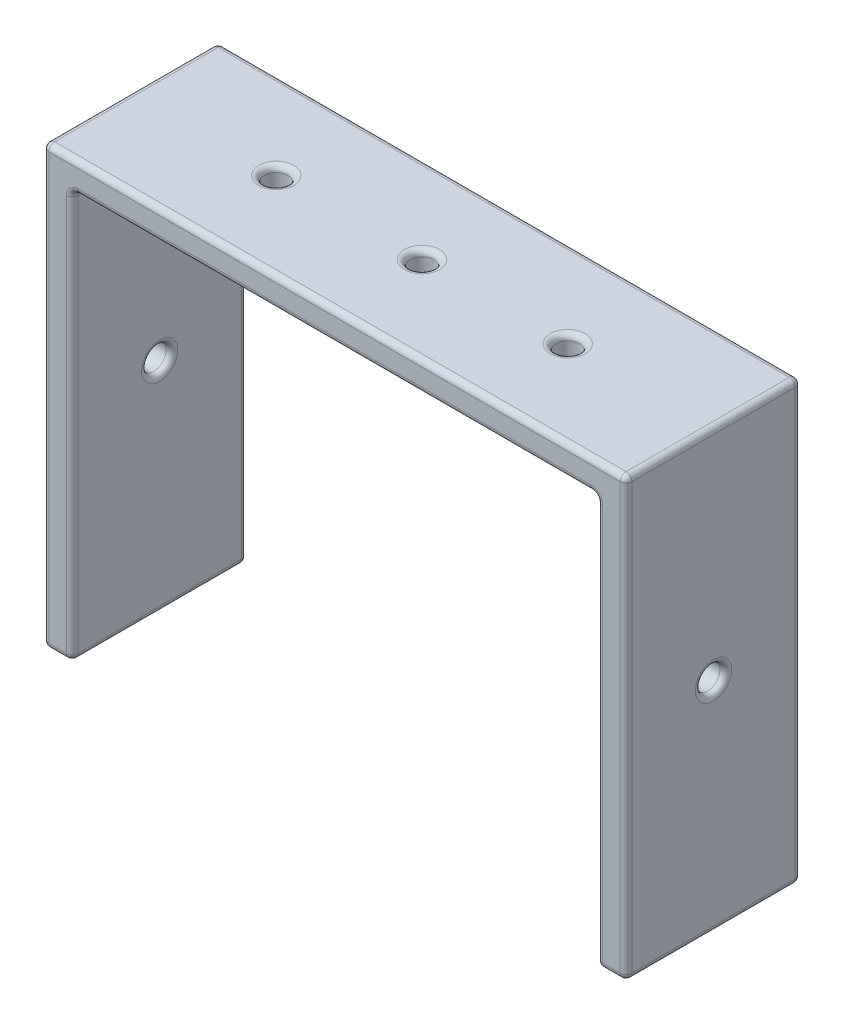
ISO-10303-21;
HEADER;
FILE_DESCRIPTION(('STEP AP214'),'2;1');
FILE_NAME('part.step','',(''),(''),'','','');
FILE_SCHEMA(('AUTOMOTIVE_DESIGN { 1 0 10303 214 1 1 1 1 }'));
ENDSEC;
DATA;
#1=APPLICATION_CONTEXT('core data for automotive mechanical design processes');
#2=APPLICATION_PROTOCOL_DEFINITION('international standard','automotive_design',2000,#1);
#3=PRODUCT_CONTEXT('',#1,'mechanical');
#4=PRODUCT('Part','Part','',(#3));
#5=PRODUCT_RELATED_PRODUCT_CATEGORY('part','',(#4));
#6=PRODUCT_DEFINITION_FORMATION('','',#4);
#7=PRODUCT_DEFINITION_CONTEXT('part definition',#1,'design');
#8=PRODUCT_DEFINITION('design','',#6,#7);
#9=PRODUCT_DEFINITION_SHAPE('','',#8);
#10=(LENGTH_UNIT() NAMED_UNIT(*) SI_UNIT(.MILLI.,.METRE.));
#11=(NAMED_UNIT(*) PLANE_ANGLE_UNIT() SI_UNIT($,.RADIAN.));
#12=(NAMED_UNIT(*) SI_UNIT($,.STERADIAN.) SOLID_ANGLE_UNIT());
#13=UNCERTAINTY_MEASURE_WITH_UNIT(LENGTH_MEASURE(1.E-05),#10,'distance_accuracy_value','');
#14=(GEOMETRIC_REPRESENTATION_CONTEXT(3) GLOBAL_UNCERTAINTY_ASSIGNED_CONTEXT((#13)) GLOBAL_UNIT_ASSIGNED_CONTEXT((#10,
#11,#12)) REPRESENTATION_CONTEXT('',''));
#15=CARTESIAN_POINT('',(0.,0.,0.));
#16=DIRECTION('',(0.,0.,1.));
#17=DIRECTION('',(1.,0.,0.));
#18=AXIS2_PLACEMENT_3D('',#15,#16,#17);
#19=CARTESIAN_POINT('',(0.,0.,0.));
#20=DIRECTION('',(0.,0.,1.));
#21=DIRECTION('',(1.,0.,0.));
#22=AXIS2_PLACEMENT_3D('',#19,#20,#21);
#23=PLANE('',#22);
#24=CARTESIAN_POINT('',(-88.,98.5449214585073,0.));
#25=DIRECTION('',(0.,0.,1.));
#26=DIRECTION('',(1.,0.,0.));
#27=AXIS2_PLACEMENT_3D('',#24,#25,#26);
#28=CIRCLE('',#27,4.);
#29=CARTESIAN_POINT('',(-92.,98.5449214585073,0.));
#30=VERTEX_POINT('',#29);
#31=CARTESIAN_POINT('',(-88.,102.544921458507,0.));
#32=VERTEX_POINT('',#31);
#33=EDGE_CURVE('E325',#30,#32,#28,.F.);
#34=ORIENTED_EDGE('',*,*,#33,.F.);
#35=DIRECTION('',(0.,1.,0.));
#36=VECTOR('',#35,1.);
#37=CARTESIAN_POINT('',(-92.,0.,0.));
#38=LINE('',#37,#36);
#39=CARTESIAN_POINT('',(-92.,-37.4550785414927,0.));
#40=VERTEX_POINT('',#39);
#41=EDGE_CURVE('E323',#30,#40,#38,.F.);
#42=ORIENTED_EDGE('',*,*,#41,.T.);
#43=DIRECTION('',(1.,0.,0.));
#44=VECTOR('',#43,1.);
#45=CARTESIAN_POINT('',(0.,-37.4550785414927,0.));
#46=LINE('',#45,#44);
#47=CARTESIAN_POINT('',(-98.,-37.4550785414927,0.));
#48=VERTEX_POINT('',#47);
#49=EDGE_CURVE('E315',#40,#48,#46,.F.);
#50=ORIENTED_EDGE('',*,*,#49,.T.);
#51=DIRECTION('',(0.,-1.,0.));
#52=VECTOR('',#51,1.);
#53=CARTESIAN_POINT('',(-98.,0.,0.));
#54=LINE('',#53,#52);
#55=CARTESIAN_POINT('',(-98.,108.544921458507,0.));
#56=VERTEX_POINT('',#55);
#57=EDGE_CURVE('E305',#48,#56,#54,.F.);
#58=ORIENTED_EDGE('',*,*,#57,.T.);
#59=DIRECTION('',(-1.,0.,0.));
#60=VECTOR('',#59,1.);
#61=CARTESIAN_POINT('',(0.,108.544921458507,0.));
#62=LINE('',#61,#60);
#63=CARTESIAN_POINT('',(98.,108.544921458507,0.));
#64=VERTEX_POINT('',#63);
#65=EDGE_CURVE('E307',#56,#64,#62,.F.);
#66=ORIENTED_EDGE('',*,*,#65,.T.);
#67=DIRECTION('',(0.,1.,0.));
#68=VECTOR('',#67,1.);
#69=CARTESIAN_POINT('',(98.,0.,0.));
#70=LINE('',#69,#68);
#71=CARTESIAN_POINT('',(98.,-37.4550785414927,0.));
#72=VERTEX_POINT('',#71);
#73=EDGE_CURVE('E309',#64,#72,#70,.F.);
#74=ORIENTED_EDGE('',*,*,#73,.T.);
#75=DIRECTION('',(1.,0.,0.));
#76=VECTOR('',#75,1.);
#77=CARTESIAN_POINT('',(0.,-37.4550785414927,0.));
#78=LINE('',#77,#76);
#79=CARTESIAN_POINT('',(92.,-37.4550785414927,0.));
#80=VERTEX_POINT('',#79);
#81=EDGE_CURVE('E311',#72,#80,#78,.F.);
#82=ORIENTED_EDGE('',*,*,#81,.T.);
#83=DIRECTION('',(0.,-1.,0.));
#84=VECTOR('',#83,1.);
#85=CARTESIAN_POINT('',(92.,0.,0.));
#86=LINE('',#85,#84);
#87=CARTESIAN_POINT('',(92.,98.5449214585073,0.));
#88=VERTEX_POINT('',#87);
#89=EDGE_CURVE('E313',#80,#88,#86,.F.);
#90=ORIENTED_EDGE('',*,*,#89,.T.);
#91=CARTESIAN_POINT('',(88.,98.5449214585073,0.));
#92=DIRECTION('',(0.,0.,1.));
#93=DIRECTION('',(1.,0.,0.));
#94=AXIS2_PLACEMENT_3D('',#91,#92,#93);
#95=CIRCLE('',#94,4.);
#96=CARTESIAN_POINT('',(88.,102.544921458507,0.));
#97=VERTEX_POINT('',#96);
#98=EDGE_CURVE('E318',#97,#88,#95,.F.);
#99=ORIENTED_EDGE('',*,*,#98,.F.);
#100=DIRECTION('',(1.,0.,0.));
#101=VECTOR('',#100,1.);
#102=CARTESIAN_POINT('',(0.,102.544921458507,0.));
#103=LINE('',#102,#101);
#104=EDGE_CURVE('E321',#97,#32,#103,.F.);
#105=ORIENTED_EDGE('',*,*,#104,.T.);
#106=EDGE_LOOP('',(#34,#42,#50,#58,#66,#74,#82,#90,#99,#105));
#107=FACE_BOUND('',#106,.T.);
#108=ADVANCED_FACE('F32',(#107),#23,.F.);
#109=CARTESIAN_POINT('',(-100.,110.544921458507,60.));
#110=DIRECTION('',(1.,0.,0.));
#111=DIRECTION('',(0.,1.,0.));
#112=AXIS2_PLACEMENT_3D('',#109,#110,#111);
#113=PLANE('',#112);
#114=DIRECTION('',(0.,-1.,0.));
#115=VECTOR('',#114,1.);
#116=CARTESIAN_POINT('',(-100.,110.544921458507,58.));
#117=LINE('',#116,#115);
#118=CARTESIAN_POINT('',(-100.,-37.4550785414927,58.));
#119=VERTEX_POINT('',#118);
#120=CARTESIAN_POINT('',(-100.,108.544921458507,58.));
#121=VERTEX_POINT('',#120);
#122=EDGE_CURVE('E41',#119,#121,#117,.F.);
#123=ORIENTED_EDGE('',*,*,#122,.T.);
#124=DIRECTION('',(0.,0.,-1.));
#125=VECTOR('',#124,1.);
#126=CARTESIAN_POINT('',(-100.,108.544921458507,60.));
#127=LINE('',#126,#125);
#128=CARTESIAN_POINT('',(-100.,108.544921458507,2.));
#129=VERTEX_POINT('',#128);
#130=EDGE_CURVE('E11',#121,#129,#127,.T.);
#131=ORIENTED_EDGE('',*,*,#130,.T.);
#132=DIRECTION('',(0.,-1.,0.));
#133=VECTOR('',#132,1.);
#134=CARTESIAN_POINT('',(-100.,110.544921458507,2.));
#135=LINE('',#134,#133);
#136=CARTESIAN_POINT('',(-100.,-37.4550785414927,2.));
#137=VERTEX_POINT('',#136);
#138=EDGE_CURVE('E391',#129,#137,#135,.T.);
#139=ORIENTED_EDGE('',*,*,#138,.T.);
#140=DIRECTION('',(0.,0.,-1.));
#141=VECTOR('',#140,1.);
#142=CARTESIAN_POINT('',(-100.,-37.4550785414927,60.));
#143=LINE('',#142,#141);
#144=EDGE_CURVE('E52',#137,#119,#143,.F.);
#145=ORIENTED_EDGE('',*,*,#144,.T.);
#146=EDGE_LOOP('',(#123,#131,#139,#145));
#147=FACE_BOUND('',#146,.T.);
#148=CARTESIAN_POINT('',(-100.,35.5449214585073,30.));
#149=DIRECTION('',(1.,0.,0.));
#150=DIRECTION('',(0.,1.,0.));
#151=AXIS2_PLACEMENT_3D('',#148,#149,#150);
#152=CIRCLE('',#151,6.2);
#153=CARTESIAN_POINT('',(-100.,41.7449214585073,30.));
#154=VERTEX_POINT('',#153);
#155=EDGE_CURVE('E388',#154,#154,#152,.T.);
#156=ORIENTED_EDGE('',*,*,#155,.T.);
#157=EDGE_LOOP('',(#156));
#158=FACE_BOUND('',#157,.T.);
#159=ADVANCED_FACE('F551',(#147,#158),#113,.F.);
#160=CARTESIAN_POINT('',(-100.,-39.4550785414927,60.));
#161=DIRECTION('',(0.,1.,0.));
#162=DIRECTION('',(0.,0.,1.));
#163=AXIS2_PLACEMENT_3D('',#160,#161,#162);
#164=PLANE('',#163);
#165=DIRECTION('',(1.,0.,0.));
#166=VECTOR('',#165,1.);
#167=CARTESIAN_POINT('',(-100.,-39.4550785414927,2.));
#168=LINE('',#167,#166);
#169=CARTESIAN_POINT('',(-98.,-39.4550785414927,2.));
#170=VERTEX_POINT('',#169);
#171=CARTESIAN_POINT('',(-92.,-39.4550785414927,2.));
#172=VERTEX_POINT('',#171);
#173=EDGE_CURVE('E260',#170,#172,#168,.T.);
#174=ORIENTED_EDGE('',*,*,#173,.T.);
#175=DIRECTION('',(0.,0.,-1.));
#176=VECTOR('',#175,1.);
#177=CARTESIAN_POINT('',(-92.,-39.4550785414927,60.));
#178=LINE('',#177,#176);
#179=CARTESIAN_POINT('',(-92.,-39.4550785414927,58.));
#180=VERTEX_POINT('',#179);
#181=EDGE_CURVE('E262',#172,#180,#178,.F.);
#182=ORIENTED_EDGE('',*,*,#181,.T.);
#183=DIRECTION('',(1.,0.,0.));
#184=VECTOR('',#183,1.);
#185=CARTESIAN_POINT('',(-100.,-39.4550785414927,58.));
#186=LINE('',#185,#184);
#187=CARTESIAN_POINT('',(-98.,-39.4550785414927,58.));
#188=VERTEX_POINT('',#187);
#189=EDGE_CURVE('E258',#180,#188,#186,.F.);
#190=ORIENTED_EDGE('',*,*,#189,.T.);
#191=DIRECTION('',(0.,0.,-1.));
#192=VECTOR('',#191,1.);
#193=CARTESIAN_POINT('',(-98.,-39.4550785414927,60.));
#194=LINE('',#193,#192);
#195=EDGE_CURVE('E256',#188,#170,#194,.T.);
#196=ORIENTED_EDGE('',*,*,#195,.T.);
#197=EDGE_LOOP('',(#174,#182,#190,#196));
#198=FACE_BOUND('',#197,.T.);
#199=ADVANCED_FACE('F557',(#198),#164,.F.);
#200=CARTESIAN_POINT('',(-90.,100.544921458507,60.));
#201=DIRECTION('',(-1.,0.,0.));
#202=DIRECTION('',(0.,0.,1.));
#203=AXIS2_PLACEMENT_3D('',#200,#201,#202);
#204=PLANE('',#203);
#205=CARTESIAN_POINT('',(-90.,35.5449214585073,30.));
#206=DIRECTION('',(-1.,0.,0.));
#207=DIRECTION('',(0.,0.,1.));
#208=AXIS2_PLACEMENT_3D('',#205,#206,#207);
#209=CIRCLE('',#208,6.2);
#210=CARTESIAN_POINT('',(-90.,35.5449214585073,36.2));
#211=VERTEX_POINT('',#210);
#212=EDGE_CURVE('E253',#211,#211,#209,.T.);
#213=ORIENTED_EDGE('',*,*,#212,.T.);
#214=EDGE_LOOP('',(#213));
#215=FACE_BOUND('',#214,.T.);
#216=DIRECTION('',(0.,0.,-1.));
#217=VECTOR('',#216,1.);
#218=CARTESIAN_POINT('',(-90.,-37.4550785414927,60.));
#219=LINE('',#218,#217);
#220=CARTESIAN_POINT('',(-90.,-37.4550785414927,58.));
#221=VERTEX_POINT('',#220);
#222=CARTESIAN_POINT('',(-90.,-37.4550785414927,2.));
#223=VERTEX_POINT('',#222);
#224=EDGE_CURVE('E215',#221,#223,#219,.T.);
#225=ORIENTED_EDGE('',*,*,#224,.T.);
#226=DIRECTION('',(0.,1.,0.));
#227=VECTOR('',#226,1.);
#228=CARTESIAN_POINT('',(-90.,100.544921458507,2.));
#229=LINE('',#228,#227);
#230=CARTESIAN_POINT('',(-90.,98.5449214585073,2.));
#231=VERTEX_POINT('',#230);
#232=EDGE_CURVE('E211',#223,#231,#229,.T.);
#233=ORIENTED_EDGE('',*,*,#232,.T.);
#234=DIRECTION('',(0.,0.,-1.));
#235=VECTOR('',#234,1.);
#236=CARTESIAN_POINT('',(-90.,98.5449214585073,60.));
#237=LINE('',#236,#235);
#238=CARTESIAN_POINT('',(-90.,98.5449214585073,58.));
#239=VERTEX_POINT('',#238);
#240=EDGE_CURVE('E203',#231,#239,#237,.F.);
#241=ORIENTED_EDGE('',*,*,#240,.T.);
#242=DIRECTION('',(0.,1.,0.));
#243=VECTOR('',#242,1.);
#244=CARTESIAN_POINT('',(-90.,-39.4550785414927,58.));
#245=LINE('',#244,#243);
#246=EDGE_CURVE('E208',#239,#221,#245,.F.);
#247=ORIENTED_EDGE('',*,*,#246,.T.);
#248=EDGE_LOOP('',(#225,#233,#241,#247));
#249=FACE_BOUND('',#248,.T.);
#250=ADVANCED_FACE('F206',(#215,#249),#204,.F.);
#251=CARTESIAN_POINT('',(-90.,100.544921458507,60.));
#252=DIRECTION('',(0.,1.,0.));
#253=DIRECTION('',(0.,0.,1.));
#254=AXIS2_PLACEMENT_3D('',#251,#252,#253);
#255=PLANE('',#254);
#256=DIRECTION('',(0.,0.,-1.));
#257=VECTOR('',#256,1.);
#258=CARTESIAN_POINT('',(-88.,100.544921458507,0.));
#259=LINE('',#258,#257);
#260=CARTESIAN_POINT('',(-88.,100.544921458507,58.));
#261=VERTEX_POINT('',#260);
#262=CARTESIAN_POINT('',(-88.,100.544921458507,2.));
#263=VERTEX_POINT('',#262);
#264=EDGE_CURVE('E223',#261,#263,#259,.T.);
#265=ORIENTED_EDGE('',*,*,#264,.T.);
#266=DIRECTION('',(1.,0.,0.));
#267=VECTOR('',#266,1.);
#268=CARTESIAN_POINT('',(-90.,100.544921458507,2.));
#269=LINE('',#268,#267);
#270=CARTESIAN_POINT('',(88.,100.544921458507,2.));
#271=VERTEX_POINT('',#270);
#272=EDGE_CURVE('E270',#263,#271,#269,.T.);
#273=ORIENTED_EDGE('',*,*,#272,.T.);
#274=DIRECTION('',(0.,0.,-1.));
#275=VECTOR('',#274,1.);
#276=CARTESIAN_POINT('',(88.,100.544921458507,60.));
#277=LINE('',#276,#275);
#278=CARTESIAN_POINT('',(88.,100.544921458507,58.));
#279=VERTEX_POINT('',#278);
#280=EDGE_CURVE('E267',#271,#279,#277,.F.);
#281=ORIENTED_EDGE('',*,*,#280,.T.);
#282=DIRECTION('',(1.,0.,0.));
#283=VECTOR('',#282,1.);
#284=CARTESIAN_POINT('',(-90.,100.544921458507,58.));
#285=LINE('',#284,#283);
#286=EDGE_CURVE('E265',#279,#261,#285,.F.);
#287=ORIENTED_EDGE('',*,*,#286,.T.);
#288=EDGE_LOOP('',(#265,#273,#281,#287));
#289=FACE_BOUND('',#288,.T.);
#290=CARTESIAN_POINT('',(50.,100.544921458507,30.));
#291=DIRECTION('',(0.,1.,0.));
#292=DIRECTION('',(0.,0.,1.));
#293=AXIS2_PLACEMENT_3D('',#290,#291,#292);
#294=CIRCLE('',#293,4.);
#295=CARTESIAN_POINT('',(50.,100.544921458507,34.));
#296=VERTEX_POINT('',#295);
#297=EDGE_CURVE('E519',#296,#296,#294,.T.);
#298=ORIENTED_EDGE('',*,*,#297,.T.);
#299=EDGE_LOOP('',(#298));
#300=FACE_BOUND('',#299,.T.);
#301=CARTESIAN_POINT('',(0.,100.544921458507,30.));
#302=DIRECTION('',(0.,1.,0.));
#303=DIRECTION('',(0.,0.,1.));
#304=AXIS2_PLACEMENT_3D('',#301,#302,#303);
#305=CIRCLE('',#304,4.);
#306=CARTESIAN_POINT('',(0.,100.544921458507,34.));
#307=VERTEX_POINT('',#306);
#308=EDGE_CURVE('E247',#307,#307,#305,.T.);
#309=ORIENTED_EDGE('',*,*,#308,.T.);
#310=EDGE_LOOP('',(#309));
#311=FACE_BOUND('',#310,.T.);
#312=CARTESIAN_POINT('',(-50.,100.544921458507,30.));
#313=DIRECTION('',(0.,1.,0.));
#314=DIRECTION('',(0.,0.,1.));
#315=AXIS2_PLACEMENT_3D('',#312,#313,#314);
#316=CIRCLE('',#315,4.);
#317=CARTESIAN_POINT('',(-50.,100.544921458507,34.));
#318=VERTEX_POINT('',#317);
#319=EDGE_CURVE('E244',#318,#318,#316,.T.);
#320=ORIENTED_EDGE('',*,*,#319,.T.);
#321=EDGE_LOOP('',(#320));
#322=FACE_BOUND('',#321,.T.);
#323=ADVANCED_FACE('F531',(#289,#300,#311,#322),#255,.F.);
#324=CARTESIAN_POINT('',(90.,-29.4550785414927,60.));
#325=DIRECTION('',(1.,0.,0.));
#326=DIRECTION('',(0.,0.,-1.));
#327=AXIS2_PLACEMENT_3D('',#324,#325,#326);
#328=PLANE('',#327);
#329=CARTESIAN_POINT('',(90.,35.5449214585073,30.));
#330=DIRECTION('',(1.,0.,0.));
#331=DIRECTION('',(0.,0.,-1.));
#332=AXIS2_PLACEMENT_3D('',#329,#330,#331);
#333=CIRCLE('',#332,6.2);
#334=CARTESIAN_POINT('',(90.,35.5449214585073,23.8));
#335=VERTEX_POINT('',#334);
#336=EDGE_CURVE('E287',#335,#335,#333,.T.);
#337=ORIENTED_EDGE('',*,*,#336,.T.);
#338=EDGE_LOOP('',(#337));
#339=FACE_BOUND('',#338,.T.);
#340=DIRECTION('',(0.,0.,-1.));
#341=VECTOR('',#340,1.);
#342=CARTESIAN_POINT('',(90.,98.5449214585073,0.));
#343=LINE('',#342,#341);
#344=CARTESIAN_POINT('',(90.,98.5449214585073,58.));
#345=VERTEX_POINT('',#344);
#346=CARTESIAN_POINT('',(90.,98.5449214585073,2.));
#347=VERTEX_POINT('',#346);
#348=EDGE_CURVE('E282',#345,#347,#343,.T.);
#349=ORIENTED_EDGE('',*,*,#348,.T.);
#350=DIRECTION('',(0.,-1.,0.));
#351=VECTOR('',#350,1.);
#352=CARTESIAN_POINT('',(90.,-29.4550785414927,2.));
#353=LINE('',#352,#351);
#354=CARTESIAN_POINT('',(90.,-37.4550785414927,2.));
#355=VERTEX_POINT('',#354);
#356=EDGE_CURVE('E285',#347,#355,#353,.T.);
#357=ORIENTED_EDGE('',*,*,#356,.T.);
#358=DIRECTION('',(0.,0.,-1.));
#359=VECTOR('',#358,1.);
#360=CARTESIAN_POINT('',(90.,-37.4550785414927,60.));
#361=LINE('',#360,#359);
#362=CARTESIAN_POINT('',(90.,-37.4550785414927,58.));
#363=VERTEX_POINT('',#362);
#364=EDGE_CURVE('E280',#355,#363,#361,.F.);
#365=ORIENTED_EDGE('',*,*,#364,.T.);
#366=DIRECTION('',(0.,-1.,0.));
#367=VECTOR('',#366,1.);
#368=CARTESIAN_POINT('',(90.,100.544921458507,58.));
#369=LINE('',#368,#367);
#370=EDGE_CURVE('E278',#363,#345,#369,.F.);
#371=ORIENTED_EDGE('',*,*,#370,.T.);
#372=EDGE_LOOP('',(#349,#357,#365,#371));
#373=FACE_BOUND('',#372,.T.);
#374=ADVANCED_FACE('F574',(#339,#373),#328,.F.);
#375=CARTESIAN_POINT('',(90.,-39.4550785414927,60.));
#376=DIRECTION('',(0.,1.,0.));
#377=DIRECTION('',(0.,0.,1.));
#378=AXIS2_PLACEMENT_3D('',#375,#376,#377);
#379=PLANE('',#378);
#380=DIRECTION('',(1.,0.,0.));
#381=VECTOR('',#380,1.);
#382=CARTESIAN_POINT('',(90.,-39.4550785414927,58.));
#383=LINE('',#382,#381);
#384=CARTESIAN_POINT('',(98.,-39.4550785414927,58.));
#385=VERTEX_POINT('',#384);
#386=CARTESIAN_POINT('',(92.,-39.4550785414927,58.));
#387=VERTEX_POINT('',#386);
#388=EDGE_CURVE('E290',#385,#387,#383,.F.);
#389=ORIENTED_EDGE('',*,*,#388,.T.);
#390=DIRECTION('',(0.,0.,-1.));
#391=VECTOR('',#390,1.);
#392=CARTESIAN_POINT('',(92.,-39.4550785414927,60.));
#393=LINE('',#392,#391);
#394=CARTESIAN_POINT('',(92.,-39.4550785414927,2.));
#395=VERTEX_POINT('',#394);
#396=EDGE_CURVE('E296',#387,#395,#393,.T.);
#397=ORIENTED_EDGE('',*,*,#396,.T.);
#398=DIRECTION('',(1.,0.,0.));
#399=VECTOR('',#398,1.);
#400=CARTESIAN_POINT('',(90.,-39.4550785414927,2.));
#401=LINE('',#400,#399);
#402=CARTESIAN_POINT('',(98.,-39.4550785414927,2.));
#403=VERTEX_POINT('',#402);
#404=EDGE_CURVE('E294',#395,#403,#401,.T.);
#405=ORIENTED_EDGE('',*,*,#404,.T.);
#406=DIRECTION('',(0.,0.,-1.));
#407=VECTOR('',#406,1.);
#408=CARTESIAN_POINT('',(98.,-39.4550785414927,60.));
#409=LINE('',#408,#407);
#410=EDGE_CURVE('E292',#403,#385,#409,.F.);
#411=ORIENTED_EDGE('',*,*,#410,.T.);
#412=EDGE_LOOP('',(#389,#397,#405,#411));
#413=FACE_BOUND('',#412,.T.);
#414=ADVANCED_FACE('F570',(#413),#379,.F.);
#415=CARTESIAN_POINT('',(100.,110.544921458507,60.));
#416=DIRECTION('',(-1.,0.,0.));
#417=DIRECTION('',(0.,-1.,0.));
#418=AXIS2_PLACEMENT_3D('',#415,#416,#417);
#419=PLANE('',#418);
#420=CARTESIAN_POINT('',(100.,35.5449214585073,30.));
#421=DIRECTION('',(-1.,0.,0.));
#422=DIRECTION('',(0.,-1.,0.));
#423=AXIS2_PLACEMENT_3D('',#420,#421,#422);
#424=CIRCLE('',#423,6.2);
#425=CARTESIAN_POINT('',(100.,29.3449214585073,30.));
#426=VERTEX_POINT('',#425);
#427=EDGE_CURVE('E337',#426,#426,#424,.T.);
#428=ORIENTED_EDGE('',*,*,#427,.T.);
#429=EDGE_LOOP('',(#428));
#430=FACE_BOUND('',#429,.T.);
#431=DIRECTION('',(0.,1.,0.));
#432=VECTOR('',#431,1.);
#433=CARTESIAN_POINT('',(100.,-39.4550785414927,58.));
#434=LINE('',#433,#432);
#435=CARTESIAN_POINT('',(100.,108.544921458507,58.));
#436=VERTEX_POINT('',#435);
#437=CARTESIAN_POINT('',(100.,-37.4550785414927,58.));
#438=VERTEX_POINT('',#437);
#439=EDGE_CURVE('E328',#436,#438,#434,.F.);
#440=ORIENTED_EDGE('',*,*,#439,.T.);
#441=DIRECTION('',(0.,0.,-1.));
#442=VECTOR('',#441,1.);
#443=CARTESIAN_POINT('',(100.,-37.4550785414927,60.));
#444=LINE('',#443,#442);
#445=CARTESIAN_POINT('',(100.,-37.4550785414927,2.));
#446=VERTEX_POINT('',#445);
#447=EDGE_CURVE('E334',#438,#446,#444,.T.);
#448=ORIENTED_EDGE('',*,*,#447,.T.);
#449=DIRECTION('',(0.,1.,0.));
#450=VECTOR('',#449,1.);
#451=CARTESIAN_POINT('',(100.,110.544921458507,2.));
#452=LINE('',#451,#450);
#453=CARTESIAN_POINT('',(100.,108.544921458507,2.));
#454=VERTEX_POINT('',#453);
#455=EDGE_CURVE('E332',#446,#454,#452,.T.);
#456=ORIENTED_EDGE('',*,*,#455,.T.);
#457=DIRECTION('',(0.,0.,-1.));
#458=VECTOR('',#457,1.);
#459=CARTESIAN_POINT('',(100.,108.544921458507,60.));
#460=LINE('',#459,#458);
#461=EDGE_CURVE('E330',#454,#436,#460,.F.);
#462=ORIENTED_EDGE('',*,*,#461,.T.);
#463=EDGE_LOOP('',(#440,#448,#456,#462));
#464=FACE_BOUND('',#463,.T.);
#465=ADVANCED_FACE('F566',(#430,#464),#419,.F.);
#466=CARTESIAN_POINT('',(-100.,110.544921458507,60.));
#467=DIRECTION('',(0.,-1.,0.));
#468=DIRECTION('',(0.,0.,-1.));
#469=AXIS2_PLACEMENT_3D('',#466,#467,#468);
#470=PLANE('',#469);
#471=CARTESIAN_POINT('',(-50.,110.544921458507,30.));
#472=DIRECTION('',(0.,-1.,0.));
#473=DIRECTION('',(0.,0.,-1.));
#474=AXIS2_PLACEMENT_3D('',#471,#472,#473);
#475=CIRCLE('',#474,6.);
#476=CARTESIAN_POINT('',(-50.,110.544921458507,24.));
#477=VERTEX_POINT('',#476);
#478=EDGE_CURVE('E355',#477,#477,#475,.T.);
#479=ORIENTED_EDGE('',*,*,#478,.T.);
#480=EDGE_LOOP('',(#479));
#481=FACE_BOUND('',#480,.T.);
#482=CARTESIAN_POINT('',(0.,110.544921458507,30.));
#483=DIRECTION('',(0.,-1.,0.));
#484=DIRECTION('',(0.,0.,-1.));
#485=AXIS2_PLACEMENT_3D('',#482,#483,#484);
#486=CIRCLE('',#485,6.);
#487=CARTESIAN_POINT('',(0.,110.544921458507,24.));
#488=VERTEX_POINT('',#487);
#489=EDGE_CURVE('E352',#488,#488,#486,.T.);
#490=ORIENTED_EDGE('',*,*,#489,.T.);
#491=EDGE_LOOP('',(#490));
#492=FACE_BOUND('',#491,.T.);
#493=CARTESIAN_POINT('',(50.,110.544921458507,30.));
#494=DIRECTION('',(0.,-1.,0.));
#495=DIRECTION('',(0.,0.,-1.));
#496=AXIS2_PLACEMENT_3D('',#493,#494,#495);
#497=CIRCLE('',#496,6.);
#498=CARTESIAN_POINT('',(50.,110.544921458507,24.));
#499=VERTEX_POINT('',#498);
#500=EDGE_CURVE('E349',#499,#499,#497,.T.);
#501=ORIENTED_EDGE('',*,*,#500,.T.);
#502=EDGE_LOOP('',(#501));
#503=FACE_BOUND('',#502,.T.);
#504=DIRECTION('',(-1.,0.,0.));
#505=VECTOR('',#504,1.);
#506=CARTESIAN_POINT('',(100.,110.544921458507,58.));
#507=LINE('',#506,#505);
#508=CARTESIAN_POINT('',(-98.,110.544921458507,58.));
#509=VERTEX_POINT('',#508);
#510=CARTESIAN_POINT('',(98.,110.544921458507,58.));
#511=VERTEX_POINT('',#510);
#512=EDGE_CURVE('E342',#509,#511,#507,.F.);
#513=ORIENTED_EDGE('',*,*,#512,.T.);
#514=DIRECTION('',(0.,0.,-1.));
#515=VECTOR('',#514,1.);
#516=CARTESIAN_POINT('',(98.,110.544921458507,60.));
#517=LINE('',#516,#515);
#518=CARTESIAN_POINT('',(98.,110.544921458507,2.));
#519=VERTEX_POINT('',#518);
#520=EDGE_CURVE('E346',#511,#519,#517,.T.);
#521=ORIENTED_EDGE('',*,*,#520,.T.);
#522=DIRECTION('',(-1.,0.,0.));
#523=VECTOR('',#522,1.);
#524=CARTESIAN_POINT('',(-100.,110.544921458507,2.));
#525=LINE('',#524,#523);
#526=CARTESIAN_POINT('',(-98.,110.544921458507,2.));
#527=VERTEX_POINT('',#526);
#528=EDGE_CURVE('E344',#519,#527,#525,.T.);
#529=ORIENTED_EDGE('',*,*,#528,.T.);
#530=DIRECTION('',(0.,0.,-1.));
#531=VECTOR('',#530,1.);
#532=CARTESIAN_POINT('',(-98.,110.544921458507,60.));
#533=LINE('',#532,#531);
#534=EDGE_CURVE('E340',#527,#509,#533,.F.);
#535=ORIENTED_EDGE('',*,*,#534,.T.);
#536=EDGE_LOOP('',(#513,#521,#529,#535));
#537=FACE_BOUND('',#536,.T.);
#538=ADVANCED_FACE('F563',(#481,#492,#503,#537),#470,.F.);
#539=CARTESIAN_POINT('',(0.,0.,60.));
#540=DIRECTION('',(0.,0.,1.));
#541=DIRECTION('',(1.,0.,0.));
#542=AXIS2_PLACEMENT_3D('',#539,#540,#541);
#543=PLANE('',#542);
#544=DIRECTION('',(0.,-1.,0.));
#545=VECTOR('',#544,1.);
#546=CARTESIAN_POINT('',(92.,-39.4550785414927,60.));
#547=LINE('',#546,#545);
#548=CARTESIAN_POINT('',(92.,98.5449214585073,60.));
#549=VERTEX_POINT('',#548);
#550=CARTESIAN_POINT('',(92.,-37.4550785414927,60.));
#551=VERTEX_POINT('',#550);
#552=EDGE_CURVE('E384',#549,#551,#547,.T.);
#553=ORIENTED_EDGE('',*,*,#552,.T.);
#554=DIRECTION('',(1.,0.,0.));
#555=VECTOR('',#554,1.);
#556=CARTESIAN_POINT('',(100.,-37.4550785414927,60.));
#557=LINE('',#556,#555);
#558=CARTESIAN_POINT('',(98.,-37.4550785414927,60.));
#559=VERTEX_POINT('',#558);
#560=EDGE_CURVE('E386',#551,#559,#557,.T.);
#561=ORIENTED_EDGE('',*,*,#560,.T.);
#562=DIRECTION('',(0.,1.,0.));
#563=VECTOR('',#562,1.);
#564=CARTESIAN_POINT('',(98.,110.544921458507,60.));
#565=LINE('',#564,#563);
#566=CARTESIAN_POINT('',(98.,108.544921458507,60.));
#567=VERTEX_POINT('',#566);
#568=EDGE_CURVE('E379',#559,#567,#565,.T.);
#569=ORIENTED_EDGE('',*,*,#568,.T.);
#570=DIRECTION('',(-1.,0.,0.));
#571=VECTOR('',#570,1.);
#572=CARTESIAN_POINT('',(-100.,108.544921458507,60.));
#573=LINE('',#572,#571);
#574=CARTESIAN_POINT('',(-98.,108.544921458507,60.));
#575=VERTEX_POINT('',#574);
#576=EDGE_CURVE('E373',#567,#575,#573,.T.);
#577=ORIENTED_EDGE('',*,*,#576,.T.);
#578=DIRECTION('',(0.,-1.,0.));
#579=VECTOR('',#578,1.);
#580=CARTESIAN_POINT('',(-98.,-39.4550785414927,60.));
#581=LINE('',#580,#579);
#582=CARTESIAN_POINT('',(-98.,-37.4550785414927,60.));
#583=VERTEX_POINT('',#582);
#584=EDGE_CURVE('E367',#575,#583,#581,.T.);
#585=ORIENTED_EDGE('',*,*,#584,.T.);
#586=DIRECTION('',(1.,0.,0.));
#587=VECTOR('',#586,1.);
#588=CARTESIAN_POINT('',(-90.,-37.4550785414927,60.));
#589=LINE('',#588,#587);
#590=CARTESIAN_POINT('',(-92.,-37.4550785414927,60.));
#591=VERTEX_POINT('',#590);
#592=EDGE_CURVE('E369',#583,#591,#589,.T.);
#593=ORIENTED_EDGE('',*,*,#592,.T.);
#594=DIRECTION('',(0.,1.,0.));
#595=VECTOR('',#594,1.);
#596=CARTESIAN_POINT('',(-92.,100.544921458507,60.));
#597=LINE('',#596,#595);
#598=CARTESIAN_POINT('',(-92.,98.5449214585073,60.));
#599=VERTEX_POINT('',#598);
#600=EDGE_CURVE('E371',#591,#599,#597,.T.);
#601=ORIENTED_EDGE('',*,*,#600,.T.);
#602=CARTESIAN_POINT('',(-88.,98.5449214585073,60.));
#603=DIRECTION('',(0.,0.,1.));
#604=DIRECTION('',(1.,0.,0.));
#605=AXIS2_PLACEMENT_3D('',#602,#603,#604);
#606=CIRCLE('',#605,4.);
#607=CARTESIAN_POINT('',(-88.,102.544921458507,60.));
#608=VERTEX_POINT('',#607);
#609=EDGE_CURVE('E234',#608,#599,#606,.T.);
#610=ORIENTED_EDGE('',*,*,#609,.F.);
#611=DIRECTION('',(1.,0.,0.));
#612=VECTOR('',#611,1.);
#613=CARTESIAN_POINT('',(90.,102.544921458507,60.));
#614=LINE('',#613,#612);
#615=CARTESIAN_POINT('',(88.,102.544921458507,60.));
#616=VERTEX_POINT('',#615);
#617=EDGE_CURVE('E377',#608,#616,#614,.T.);
#618=ORIENTED_EDGE('',*,*,#617,.T.);
#619=CARTESIAN_POINT('',(88.,98.5449214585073,60.));
#620=DIRECTION('',(0.,0.,1.));
#621=DIRECTION('',(1.,0.,0.));
#622=AXIS2_PLACEMENT_3D('',#619,#620,#621);
#623=CIRCLE('',#622,4.);
#624=EDGE_CURVE('E381',#549,#616,#623,.T.);
#625=ORIENTED_EDGE('',*,*,#624,.F.);
#626=EDGE_LOOP('',(#553,#561,#569,#577,#585,#593,#601,#610,#618,#625));
#627=FACE_BOUND('',#626,.T.);
#628=ADVANCED_FACE('F561',(#627),#543,.T.);
#629=CARTESIAN_POINT('',(110.,35.5449214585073,30.));
#630=DIRECTION('',(-1.,0.,0.));
#631=DIRECTION('',(0.,-1.,0.));
#632=AXIS2_PLACEMENT_3D('',#629,#630,#631);
#633=CYLINDRICAL_SURFACE('',#632,4.2);
#634=CARTESIAN_POINT('',(92.,35.5449214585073,30.));
#635=DIRECTION('',(1.,0.,0.));
#636=DIRECTION('',(0.,0.,-1.));
#637=AXIS2_PLACEMENT_3D('',#634,#635,#636);
#638=CIRCLE('',#637,4.2);
#639=CARTESIAN_POINT('',(92.,31.3449214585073,30.));
#640=VERTEX_POINT('',#639);
#641=EDGE_CURVE('E302',#640,#640,#638,.F.);
#642=CARTESIAN_POINT('',(98.,35.5449214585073,30.));
#643=DIRECTION('',(-1.,0.,0.));
#644=DIRECTION('',(0.,-1.,0.));
#645=AXIS2_PLACEMENT_3D('',#642,#643,#644);
#646=CIRCLE('',#645,4.2);
#647=CARTESIAN_POINT('',(98.,31.3449214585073,30.));
#648=VERTEX_POINT('',#647);
#649=EDGE_CURVE('E299',#648,#648,#646,.F.);
#650=CARTESIAN_POINT('',(92.,31.3449214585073,30.));
#651=CARTESIAN_POINT('',(92.0625,31.3449214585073,30.));
#652=CARTESIAN_POINT('',(92.125,31.3449214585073,30.));
#653=CARTESIAN_POINT('',(92.25,31.3449214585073,30.));
#654=CARTESIAN_POINT('',(92.3125,31.3449214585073,30.));
#655=CARTESIAN_POINT('',(92.4375,31.3449214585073,30.));
#656=CARTESIAN_POINT('',(92.5,31.3449214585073,30.));
#657=CARTESIAN_POINT('',(92.625,31.3449214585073,30.));
#658=CARTESIAN_POINT('',(92.6875,31.3449214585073,30.));
#659=CARTESIAN_POINT('',(92.8125,31.3449214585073,30.));
#660=CARTESIAN_POINT('',(92.875,31.3449214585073,30.));
#661=CARTESIAN_POINT('',(93.,31.3449214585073,30.));
#662=CARTESIAN_POINT('',(93.0625,31.3449214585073,30.));
#663=CARTESIAN_POINT('',(93.1875,31.3449214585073,30.));
#664=CARTESIAN_POINT('',(93.25,31.3449214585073,30.));
#665=CARTESIAN_POINT('',(93.375,31.3449214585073,30.));
#666=CARTESIAN_POINT('',(93.4375,31.3449214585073,30.));
#667=CARTESIAN_POINT('',(93.5625,31.3449214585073,30.));
#668=CARTESIAN_POINT('',(93.625,31.3449214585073,30.));
#669=CARTESIAN_POINT('',(93.75,31.3449214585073,30.));
#670=CARTESIAN_POINT('',(93.8125,31.3449214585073,30.));
#671=CARTESIAN_POINT('',(93.9375,31.3449214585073,30.));
#672=CARTESIAN_POINT('',(94.,31.3449214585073,30.));
#673=CARTESIAN_POINT('',(94.125,31.3449214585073,30.));
#674=CARTESIAN_POINT('',(94.1875,31.3449214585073,30.));
#675=CARTESIAN_POINT('',(94.3125,31.3449214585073,30.));
#676=CARTESIAN_POINT('',(94.375,31.3449214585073,30.));
#677=CARTESIAN_POINT('',(94.5,31.3449214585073,30.));
#678=CARTESIAN_POINT('',(94.5625,31.3449214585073,30.));
#679=CARTESIAN_POINT('',(94.6875,31.3449214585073,30.));
#680=CARTESIAN_POINT('',(94.75,31.3449214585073,30.));
#681=CARTESIAN_POINT('',(94.875,31.3449214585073,30.));
#682=CARTESIAN_POINT('',(94.9375,31.3449214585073,30.));
#683=CARTESIAN_POINT('',(95.0625,31.3449214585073,30.));
#684=CARTESIAN_POINT('',(95.125,31.3449214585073,30.));
#685=CARTESIAN_POINT('',(95.25,31.3449214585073,30.));
#686=CARTESIAN_POINT('',(95.3125,31.3449214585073,30.));
#687=CARTESIAN_POINT('',(95.4375,31.3449214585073,30.));
#688=CARTESIAN_POINT('',(95.5,31.3449214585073,30.));
#689=CARTESIAN_POINT('',(95.625,31.3449214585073,30.));
#690=CARTESIAN_POINT('',(95.6875,31.3449214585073,30.));
#691=CARTESIAN_POINT('',(95.8125,31.3449214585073,30.));
#692=CARTESIAN_POINT('',(95.875,31.3449214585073,30.));
#693=CARTESIAN_POINT('',(96.,31.3449214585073,30.));
#694=CARTESIAN_POINT('',(96.0625,31.3449214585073,30.));
#695=CARTESIAN_POINT('',(96.1875,31.3449214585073,30.));
#696=CARTESIAN_POINT('',(96.25,31.3449214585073,30.));
#697=CARTESIAN_POINT('',(96.375,31.3449214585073,30.));
#698=CARTESIAN_POINT('',(96.4375,31.3449214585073,30.));
#699=CARTESIAN_POINT('',(96.5625,31.3449214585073,30.));
#700=CARTESIAN_POINT('',(96.625,31.3449214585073,30.));
#701=CARTESIAN_POINT('',(96.75,31.3449214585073,30.));
#702=CARTESIAN_POINT('',(96.8125,31.3449214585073,30.));
#703=CARTESIAN_POINT('',(96.9375,31.3449214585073,30.));
#704=CARTESIAN_POINT('',(97.,31.3449214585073,30.));
#705=CARTESIAN_POINT('',(97.125,31.3449214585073,30.));
#706=CARTESIAN_POINT('',(97.1875,31.3449214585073,30.));
#707=CARTESIAN_POINT('',(97.3125,31.3449214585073,30.));
#708=CARTESIAN_POINT('',(97.375,31.3449214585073,30.));
#709=CARTESIAN_POINT('',(97.5,31.3449214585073,30.));
#710=CARTESIAN_POINT('',(97.5625,31.3449214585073,30.));
#711=CARTESIAN_POINT('',(97.6875,31.3449214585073,30.));
#712=CARTESIAN_POINT('',(97.75,31.3449214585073,30.));
#713=CARTESIAN_POINT('',(97.875,31.3449214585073,30.));
#714=CARTESIAN_POINT('',(97.9375,31.3449214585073,30.));
#715=CARTESIAN_POINT('',(98.,31.3449214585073,30.));
#716=B_SPLINE_CURVE_WITH_KNOTS('',3,(#650,#651,#652,#653,#654,#655,#656,#657,#658,#659,#660,
#661,#662,#663,#664,#665,#666,#667,#668,#669,#670,#671,#672,#673,#674,#675,#676,#677,#678,#679,
#680,#681,#682,#683,#684,#685,#686,#687,#688,#689,#690,#691,#692,#693,#694,#695,#696,#697,#698,
#699,#700,#701,#702,#703,#704,#705,#706,#707,#708,#709,#710,#711,#712,#713,#714,#715),
.UNSPECIFIED.,.F.,.F.,(4,2,2,2,2,2,2,2,2,2,2,2,2,2,2,2,2,2,2,2,2,2,2,2,2,2,2,2,2,2,2,2,4),(0.,
0.187499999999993,0.374999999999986,0.562499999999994,0.750000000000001,0.937499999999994,1.125,
1.31249999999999,1.5,1.68749999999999,1.875,2.06249999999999,2.25,2.4375,2.625,2.8125,3.,
3.18750000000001,3.375,3.56250000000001,3.75,3.93750000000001,4.125,4.31250000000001,4.5,
4.68750000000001,4.875,5.06250000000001,5.25,5.43750000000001,5.62500000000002,5.81250000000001,
6.00000000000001),.UNSPECIFIED.);
#717=EDGE_CURVE('BSEAM852',#640,#648,#716,.T.);
#718=ORIENTED_EDGE('',*,*,#641,.T.);
#719=ORIENTED_EDGE('',*,*,#649,.T.);
#720=ORIENTED_EDGE('',*,*,#717,.T.);
#721=ORIENTED_EDGE('',*,*,#717,.F.);
#722=EDGE_LOOP('',(#718,#720,#719,#721));
#723=FACE_BOUND('',#722,.T.);
#724=ADVANCED_FACE('F852',(#723),#633,.F.);
#725=CARTESIAN_POINT('',(-92.,35.5449214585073,30.));
#726=DIRECTION('',(-1.,0.,0.));
#727=DIRECTION('',(0.,0.,1.));
#728=AXIS2_PLACEMENT_3D('',#725,#726,#727);
#729=CIRCLE('',#728,4.2);
#730=CARTESIAN_POINT('',(-92.,31.3449214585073,30.));
#731=VERTEX_POINT('',#730);
#732=EDGE_CURVE('E275',#731,#731,#729,.F.);
#733=CARTESIAN_POINT('',(-98.,35.5449214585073,30.));
#734=DIRECTION('',(1.,0.,0.));
#735=DIRECTION('',(0.,1.,0.));
#736=AXIS2_PLACEMENT_3D('',#733,#734,#735);
#737=CIRCLE('',#736,4.2);
#738=CARTESIAN_POINT('',(-98.,31.3449214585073,30.));
#739=VERTEX_POINT('',#738);
#740=EDGE_CURVE('E272',#739,#739,#737,.F.);
#741=CARTESIAN_POINT('',(-92.,31.3449214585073,30.));
#742=CARTESIAN_POINT('',(-92.0625,31.3449214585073,30.));
#743=CARTESIAN_POINT('',(-92.125,31.3449214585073,30.));
#744=CARTESIAN_POINT('',(-92.25,31.3449214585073,30.));
#745=CARTESIAN_POINT('',(-92.3125,31.3449214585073,30.));
#746=CARTESIAN_POINT('',(-92.4375,31.3449214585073,30.));
#747=CARTESIAN_POINT('',(-92.5,31.3449214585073,30.));
#748=CARTESIAN_POINT('',(-92.625,31.3449214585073,30.));
#749=CARTESIAN_POINT('',(-92.6875,31.3449214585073,30.));
#750=CARTESIAN_POINT('',(-92.8125,31.3449214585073,30.));
#751=CARTESIAN_POINT('',(-92.875,31.3449214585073,30.));
#752=CARTESIAN_POINT('',(-93.,31.3449214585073,30.));
#753=CARTESIAN_POINT('',(-93.0625,31.3449214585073,30.));
#754=CARTESIAN_POINT('',(-93.1875,31.3449214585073,30.));
#755=CARTESIAN_POINT('',(-93.25,31.3449214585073,30.));
#756=CARTESIAN_POINT('',(-93.375,31.3449214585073,30.));
#757=CARTESIAN_POINT('',(-93.4375,31.3449214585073,30.));
#758=CARTESIAN_POINT('',(-93.5625,31.3449214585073,30.));
#759=CARTESIAN_POINT('',(-93.625,31.3449214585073,30.));
#760=CARTESIAN_POINT('',(-93.75,31.3449214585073,30.));
#761=CARTESIAN_POINT('',(-93.8125,31.3449214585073,30.));
#762=CARTESIAN_POINT('',(-93.9375,31.3449214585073,30.));
#763=CARTESIAN_POINT('',(-94.,31.3449214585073,30.));
#764=CARTESIAN_POINT('',(-94.125,31.3449214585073,30.));
#765=CARTESIAN_POINT('',(-94.1875,31.3449214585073,30.));
#766=CARTESIAN_POINT('',(-94.3125,31.3449214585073,30.));
#767=CARTESIAN_POINT('',(-94.375,31.3449214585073,30.));
#768=CARTESIAN_POINT('',(-94.5,31.3449214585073,30.));
#769=CARTESIAN_POINT('',(-94.5625,31.3449214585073,30.));
#770=CARTESIAN_POINT('',(-94.6875,31.3449214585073,30.));
#771=CARTESIAN_POINT('',(-94.75,31.3449214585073,30.));
#772=CARTESIAN_POINT('',(-94.875,31.3449214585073,30.));
#773=CARTESIAN_POINT('',(-94.9375,31.3449214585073,30.));
#774=CARTESIAN_POINT('',(-95.0625,31.3449214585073,30.));
#775=CARTESIAN_POINT('',(-95.125,31.3449214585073,30.));
#776=CARTESIAN_POINT('',(-95.25,31.3449214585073,30.));
#777=CARTESIAN_POINT('',(-95.3125,31.3449214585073,30.));
#778=CARTESIAN_POINT('',(-95.4375,31.3449214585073,30.));
#779=CARTESIAN_POINT('',(-95.5,31.3449214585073,30.));
#780=CARTESIAN_POINT('',(-95.625,31.3449214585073,30.));
#781=CARTESIAN_POINT('',(-95.6875,31.3449214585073,30.));
#782=CARTESIAN_POINT('',(-95.8125,31.3449214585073,30.));
#783=CARTESIAN_POINT('',(-95.875,31.3449214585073,30.));
#784=CARTESIAN_POINT('',(-96.,31.3449214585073,30.));
#785=CARTESIAN_POINT('',(-96.0625,31.3449214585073,30.));
#786=CARTESIAN_POINT('',(-96.1875,31.3449214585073,30.));
#787=CARTESIAN_POINT('',(-96.25,31.3449214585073,30.));
#788=CARTESIAN_POINT('',(-96.375,31.3449214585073,30.));
#789=CARTESIAN_POINT('',(-96.4375,31.3449214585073,30.));
#790=CARTESIAN_POINT('',(-96.5625,31.3449214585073,30.));
#791=CARTESIAN_POINT('',(-96.625,31.3449214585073,30.));
#792=CARTESIAN_POINT('',(-96.75,31.3449214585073,30.));
#793=CARTESIAN_POINT('',(-96.8125,31.3449214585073,30.));
#794=CARTESIAN_POINT('',(-96.9375,31.3449214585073,30.));
#795=CARTESIAN_POINT('',(-97.,31.3449214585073,30.));
#796=CARTESIAN_POINT('',(-97.125,31.3449214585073,30.));
#797=CARTESIAN_POINT('',(-97.1875,31.3449214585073,30.));
#798=CARTESIAN_POINT('',(-97.3125,31.3449214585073,30.));
#799=CARTESIAN_POINT('',(-97.375,31.3449214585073,30.));
#800=CARTESIAN_POINT('',(-97.5,31.3449214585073,30.));
#801=CARTESIAN_POINT('',(-97.5625,31.3449214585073,30.));
#802=CARTESIAN_POINT('',(-97.6875,31.3449214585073,30.));
#803=CARTESIAN_POINT('',(-97.75,31.3449214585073,30.));
#804=CARTESIAN_POINT('',(-97.875,31.3449214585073,30.));
#805=CARTESIAN_POINT('',(-97.9375,31.3449214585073,30.));
#806=CARTESIAN_POINT('',(-98.,31.3449214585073,30.));
#807=B_SPLINE_CURVE_WITH_KNOTS('',3,(#741,#742,#743,#744,#745,#746,#747,#748,#749,#750,#751,
#752,#753,#754,#755,#756,#757,#758,#759,#760,#761,#762,#763,#764,#765,#766,#767,#768,#769,#770,
#771,#772,#773,#774,#775,#776,#777,#778,#779,#780,#781,#782,#783,#784,#785,#786,#787,#788,#789,
#790,#791,#792,#793,#794,#795,#796,#797,#798,#799,#800,#801,#802,#803,#804,#805,#806),
.UNSPECIFIED.,.F.,.F.,(4,2,2,2,2,2,2,2,2,2,2,2,2,2,2,2,2,2,2,2,2,2,2,2,2,2,2,2,2,2,2,2,4),(0.,
0.187500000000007,0.375000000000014,0.562499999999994,0.750000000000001,0.937500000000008,
1.12499999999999,1.31249999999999,1.5,1.68750000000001,1.87500000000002,2.06249999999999,2.25,
2.43750000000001,2.62499999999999,2.8125,3.,3.18750000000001,3.37500000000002,3.5625,3.75,
3.93750000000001,4.12499999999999,4.3125,4.5,4.68750000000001,4.87500000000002,5.0625,5.25,
5.43750000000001,5.62499999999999,5.8125,6.00000000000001),.UNSPECIFIED.);
#808=EDGE_CURVE('BSEAM547',#731,#739,#807,.T.);
#809=ORIENTED_EDGE('',*,*,#732,.T.);
#810=ORIENTED_EDGE('',*,*,#740,.T.);
#811=ORIENTED_EDGE('',*,*,#808,.T.);
#812=ORIENTED_EDGE('',*,*,#808,.F.);
#813=EDGE_LOOP('',(#809,#811,#810,#812));
#814=FACE_BOUND('',#813,.T.);
#815=ADVANCED_FACE('F547',(#814),#633,.F.);
#816=CARTESIAN_POINT('',(-50.,-99.4550785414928,30.));
#817=DIRECTION('',(0.,1.,0.));
#818=DIRECTION('',(0.,0.,1.));
#819=AXIS2_PLACEMENT_3D('',#816,#817,#818);
#820=CYLINDRICAL_SURFACE('',#819,4.);
#821=CARTESIAN_POINT('',(-50.,108.544921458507,30.));
#822=DIRECTION('',(0.,-1.,0.));
#823=DIRECTION('',(0.,0.,-1.));
#824=AXIS2_PLACEMENT_3D('',#821,#822,#823);
#825=CIRCLE('',#824,4.);
#826=CARTESIAN_POINT('',(-50.,108.544921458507,34.));
#827=VERTEX_POINT('',#826);
#828=EDGE_CURVE('E358',#827,#827,#825,.F.);
#829=CARTESIAN_POINT('',(-50.,108.544921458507,34.));
#830=CARTESIAN_POINT('',(-50.,108.461588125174,34.));
#831=CARTESIAN_POINT('',(-50.,108.378254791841,34.));
#832=CARTESIAN_POINT('',(-50.,108.211588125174,34.));
#833=CARTESIAN_POINT('',(-50.,108.128254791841,34.));
#834=CARTESIAN_POINT('',(-50.,107.961588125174,34.));
#835=CARTESIAN_POINT('',(-50.,107.878254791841,34.));
#836=CARTESIAN_POINT('',(-50.,107.711588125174,34.));
#837=CARTESIAN_POINT('',(-50.,107.628254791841,34.));
#838=CARTESIAN_POINT('',(-50.,107.461588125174,34.));
#839=CARTESIAN_POINT('',(-50.,107.378254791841,34.));
#840=CARTESIAN_POINT('',(-50.,107.211588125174,34.));
#841=CARTESIAN_POINT('',(-50.,107.128254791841,34.));
#842=CARTESIAN_POINT('',(-50.,106.961588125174,34.));
#843=CARTESIAN_POINT('',(-50.,106.878254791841,34.));
#844=CARTESIAN_POINT('',(-50.,106.711588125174,34.));
#845=CARTESIAN_POINT('',(-50.,106.628254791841,34.));
#846=CARTESIAN_POINT('',(-50.,106.461588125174,34.));
#847=CARTESIAN_POINT('',(-50.,106.378254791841,34.));
#848=CARTESIAN_POINT('',(-50.,106.211588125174,34.));
#849=CARTESIAN_POINT('',(-50.,106.128254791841,34.));
#850=CARTESIAN_POINT('',(-50.,105.961588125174,34.));
#851=CARTESIAN_POINT('',(-50.,105.878254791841,34.));
#852=CARTESIAN_POINT('',(-50.,105.711588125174,34.));
#853=CARTESIAN_POINT('',(-50.,105.628254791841,34.));
#854=CARTESIAN_POINT('',(-50.,105.461588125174,34.));
#855=CARTESIAN_POINT('',(-50.,105.378254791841,34.));
#856=CARTESIAN_POINT('',(-50.,105.211588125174,34.));
#857=CARTESIAN_POINT('',(-50.,105.128254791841,34.));
#858=CARTESIAN_POINT('',(-50.,104.961588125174,34.));
#859=CARTESIAN_POINT('',(-50.,104.878254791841,34.));
#860=CARTESIAN_POINT('',(-50.,104.711588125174,34.));
#861=CARTESIAN_POINT('',(-50.,104.628254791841,34.));
#862=CARTESIAN_POINT('',(-50.,104.461588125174,34.));
#863=CARTESIAN_POINT('',(-50.,104.378254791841,34.));
#864=CARTESIAN_POINT('',(-50.,104.211588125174,34.));
#865=CARTESIAN_POINT('',(-50.,104.128254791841,34.));
#866=CARTESIAN_POINT('',(-50.,103.961588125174,34.));
#867=CARTESIAN_POINT('',(-50.,103.878254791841,34.));
#868=CARTESIAN_POINT('',(-50.,103.711588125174,34.));
#869=CARTESIAN_POINT('',(-50.,103.628254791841,34.));
#870=CARTESIAN_POINT('',(-50.,103.461588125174,34.));
#871=CARTESIAN_POINT('',(-50.,103.378254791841,34.));
#872=CARTESIAN_POINT('',(-50.,103.211588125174,34.));
#873=CARTESIAN_POINT('',(-50.,103.128254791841,34.));
#874=CARTESIAN_POINT('',(-50.,102.961588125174,34.));
#875=CARTESIAN_POINT('',(-50.,102.878254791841,34.));
#876=CARTESIAN_POINT('',(-50.,102.711588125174,34.));
#877=CARTESIAN_POINT('',(-50.,102.628254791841,34.));
#878=CARTESIAN_POINT('',(-50.,102.461588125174,34.));
#879=CARTESIAN_POINT('',(-50.,102.378254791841,34.));
#880=CARTESIAN_POINT('',(-50.,102.211588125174,34.));
#881=CARTESIAN_POINT('',(-50.,102.128254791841,34.));
#882=CARTESIAN_POINT('',(-50.,101.961588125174,34.));
#883=CARTESIAN_POINT('',(-50.,101.878254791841,34.));
#884=CARTESIAN_POINT('',(-50.,101.711588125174,34.));
#885=CARTESIAN_POINT('',(-50.,101.628254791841,34.));
#886=CARTESIAN_POINT('',(-50.,101.461588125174,34.));
#887=CARTESIAN_POINT('',(-50.,101.378254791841,34.));
#888=CARTESIAN_POINT('',(-50.,101.211588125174,34.));
#889=CARTESIAN_POINT('',(-50.,101.128254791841,34.));
#890=CARTESIAN_POINT('',(-50.,100.961588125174,34.));
#891=CARTESIAN_POINT('',(-50.,100.878254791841,34.));
#892=CARTESIAN_POINT('',(-50.,100.711588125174,34.));
#893=CARTESIAN_POINT('',(-50.,100.628254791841,34.));
#894=CARTESIAN_POINT('',(-50.,100.544921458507,34.));
#895=B_SPLINE_CURVE_WITH_KNOTS('',3,(#829,#830,#831,#832,#833,#834,#835,#836,#837,#838,#839,
#840,#841,#842,#843,#844,#845,#846,#847,#848,#849,#850,#851,#852,#853,#854,#855,#856,#857,#858,
#859,#860,#861,#862,#863,#864,#865,#866,#867,#868,#869,#870,#871,#872,#873,#874,#875,#876,#877,
#878,#879,#880,#881,#882,#883,#884,#885,#886,#887,#888,#889,#890,#891,#892,#893,#894),
.UNSPECIFIED.,.F.,.F.,(4,2,2,2,2,2,2,2,2,2,2,2,2,2,2,2,2,2,2,2,2,2,2,2,2,2,2,2,2,2,2,2,4),(0.,
0.25,0.5,0.750000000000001,1.,1.25,1.5,1.75,2.,2.25,2.5,2.75,3.,3.25,3.5,3.75,4.,4.25,4.5,4.75,
5.,5.25,5.50000000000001,5.75000000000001,6.00000000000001,6.25000000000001,6.50000000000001,
6.75000000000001,7.00000000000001,7.25000000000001,7.50000000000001,7.75000000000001,
8.00000000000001),.UNSPECIFIED.);
#896=EDGE_CURVE('BSEAM537',#827,#318,#895,.T.);
#897=ORIENTED_EDGE('',*,*,#828,.T.);
#898=ORIENTED_EDGE('',*,*,#319,.F.);
#899=ORIENTED_EDGE('',*,*,#896,.T.);
#900=ORIENTED_EDGE('',*,*,#896,.F.);
#901=EDGE_LOOP('',(#897,#899,#898,#900));
#902=FACE_BOUND('',#901,.T.);
#903=ADVANCED_FACE('F537',(#902),#820,.F.);
#904=CARTESIAN_POINT('',(0.,-99.4550785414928,30.));
#905=DIRECTION('',(0.,1.,0.));
#906=DIRECTION('',(0.,0.,1.));
#907=AXIS2_PLACEMENT_3D('',#904,#905,#906);
#908=CYLINDRICAL_SURFACE('',#907,4.);
#909=CARTESIAN_POINT('',(0.,108.544921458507,30.));
#910=DIRECTION('',(0.,-1.,0.));
#911=DIRECTION('',(0.,0.,-1.));
#912=AXIS2_PLACEMENT_3D('',#909,#910,#911);
#913=CIRCLE('',#912,4.);
#914=CARTESIAN_POINT('',(0.,108.544921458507,34.));
#915=VERTEX_POINT('',#914);
#916=EDGE_CURVE('E361',#915,#915,#913,.F.);
#917=CARTESIAN_POINT('',(0.,108.544921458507,34.));
#918=CARTESIAN_POINT('',(0.,108.461588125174,34.));
#919=CARTESIAN_POINT('',(0.,108.378254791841,34.));
#920=CARTESIAN_POINT('',(0.,108.211588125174,34.));
#921=CARTESIAN_POINT('',(0.,108.128254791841,34.));
#922=CARTESIAN_POINT('',(0.,107.961588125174,34.));
#923=CARTESIAN_POINT('',(0.,107.878254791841,34.));
#924=CARTESIAN_POINT('',(0.,107.711588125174,34.));
#925=CARTESIAN_POINT('',(0.,107.628254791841,34.));
#926=CARTESIAN_POINT('',(0.,107.461588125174,34.));
#927=CARTESIAN_POINT('',(0.,107.378254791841,34.));
#928=CARTESIAN_POINT('',(0.,107.211588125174,34.));
#929=CARTESIAN_POINT('',(0.,107.128254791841,34.));
#930=CARTESIAN_POINT('',(0.,106.961588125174,34.));
#931=CARTESIAN_POINT('',(0.,106.878254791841,34.));
#932=CARTESIAN_POINT('',(0.,106.711588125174,34.));
#933=CARTESIAN_POINT('',(0.,106.628254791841,34.));
#934=CARTESIAN_POINT('',(0.,106.461588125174,34.));
#935=CARTESIAN_POINT('',(0.,106.378254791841,34.));
#936=CARTESIAN_POINT('',(0.,106.211588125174,34.));
#937=CARTESIAN_POINT('',(0.,106.128254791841,34.));
#938=CARTESIAN_POINT('',(0.,105.961588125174,34.));
#939=CARTESIAN_POINT('',(0.,105.878254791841,34.));
#940=CARTESIAN_POINT('',(0.,105.711588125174,34.));
#941=CARTESIAN_POINT('',(0.,105.628254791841,34.));
#942=CARTESIAN_POINT('',(0.,105.461588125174,34.));
#943=CARTESIAN_POINT('',(0.,105.378254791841,34.));
#944=CARTESIAN_POINT('',(0.,105.211588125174,34.));
#945=CARTESIAN_POINT('',(0.,105.128254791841,34.));
#946=CARTESIAN_POINT('',(0.,104.961588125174,34.));
#947=CARTESIAN_POINT('',(0.,104.878254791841,34.));
#948=CARTESIAN_POINT('',(0.,104.711588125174,34.));
#949=CARTESIAN_POINT('',(0.,104.628254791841,34.));
#950=CARTESIAN_POINT('',(0.,104.461588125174,34.));
#951=CARTESIAN_POINT('',(0.,104.378254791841,34.));
#952=CARTESIAN_POINT('',(0.,104.211588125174,34.));
#953=CARTESIAN_POINT('',(0.,104.128254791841,34.));
#954=CARTESIAN_POINT('',(0.,103.961588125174,34.));
#955=CARTESIAN_POINT('',(0.,103.878254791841,34.));
#956=CARTESIAN_POINT('',(0.,103.711588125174,34.));
#957=CARTESIAN_POINT('',(0.,103.628254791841,34.));
#958=CARTESIAN_POINT('',(0.,103.461588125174,34.));
#959=CARTESIAN_POINT('',(0.,103.378254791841,34.));
#960=CARTESIAN_POINT('',(0.,103.211588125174,34.));
#961=CARTESIAN_POINT('',(0.,103.128254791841,34.));
#962=CARTESIAN_POINT('',(0.,102.961588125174,34.));
#963=CARTESIAN_POINT('',(0.,102.878254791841,34.));
#964=CARTESIAN_POINT('',(0.,102.711588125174,34.));
#965=CARTESIAN_POINT('',(0.,102.628254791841,34.));
#966=CARTESIAN_POINT('',(0.,102.461588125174,34.));
#967=CARTESIAN_POINT('',(0.,102.378254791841,34.));
#968=CARTESIAN_POINT('',(0.,102.211588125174,34.));
#969=CARTESIAN_POINT('',(0.,102.128254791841,34.));
#970=CARTESIAN_POINT('',(0.,101.961588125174,34.));
#971=CARTESIAN_POINT('',(0.,101.878254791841,34.));
#972=CARTESIAN_POINT('',(0.,101.711588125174,34.));
#973=CARTESIAN_POINT('',(0.,101.628254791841,34.));
#974=CARTESIAN_POINT('',(0.,101.461588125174,34.));
#975=CARTESIAN_POINT('',(0.,101.378254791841,34.));
#976=CARTESIAN_POINT('',(0.,101.211588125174,34.));
#977=CARTESIAN_POINT('',(0.,101.128254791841,34.));
#978=CARTESIAN_POINT('',(0.,100.961588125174,34.));
#979=CARTESIAN_POINT('',(0.,100.878254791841,34.));
#980=CARTESIAN_POINT('',(0.,100.711588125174,34.));
#981=CARTESIAN_POINT('',(0.,100.628254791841,34.));
#982=CARTESIAN_POINT('',(0.,100.544921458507,34.));
#983=B_SPLINE_CURVE_WITH_KNOTS('',3,(#917,#918,#919,#920,#921,#922,#923,#924,#925,#926,#927,
#928,#929,#930,#931,#932,#933,#934,#935,#936,#937,#938,#939,#940,#941,#942,#943,#944,#945,#946,
#947,#948,#949,#950,#951,#952,#953,#954,#955,#956,#957,#958,#959,#960,#961,#962,#963,#964,#965,
#966,#967,#968,#969,#970,#971,#972,#973,#974,#975,#976,#977,#978,#979,#980,#981,#982),
.UNSPECIFIED.,.F.,.F.,(4,2,2,2,2,2,2,2,2,2,2,2,2,2,2,2,2,2,2,2,2,2,2,2,2,2,2,2,2,2,2,2,4),(0.,
0.25,0.5,0.750000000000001,1.,1.25,1.5,1.75,2.,2.25,2.5,2.75,3.,3.25,3.5,3.75,4.,4.25,4.5,4.75,
5.,5.25,5.50000000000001,5.75000000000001,6.00000000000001,6.25000000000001,6.50000000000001,
6.75000000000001,7.00000000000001,7.25000000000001,7.50000000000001,7.75000000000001,
8.00000000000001),.UNSPECIFIED.);
#984=EDGE_CURVE('BSEAM534',#915,#307,#983,.T.);
#985=ORIENTED_EDGE('',*,*,#916,.T.);
#986=ORIENTED_EDGE('',*,*,#308,.F.);
#987=ORIENTED_EDGE('',*,*,#984,.T.);
#988=ORIENTED_EDGE('',*,*,#984,.F.);
#989=EDGE_LOOP('',(#985,#987,#986,#988));
#990=FACE_BOUND('',#989,.T.);
#991=ADVANCED_FACE('F534',(#990),#908,.F.);
#992=CARTESIAN_POINT('',(50.,-99.4550785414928,30.));
#993=DIRECTION('',(0.,1.,0.));
#994=DIRECTION('',(0.,0.,1.));
#995=AXIS2_PLACEMENT_3D('',#992,#993,#994);
#996=CYLINDRICAL_SURFACE('',#995,4.);
#997=CARTESIAN_POINT('',(50.,108.544921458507,30.));
#998=DIRECTION('',(0.,-1.,0.));
#999=DIRECTION('',(0.,0.,-1.));
#1000=AXIS2_PLACEMENT_3D('',#997,#998,#999);
#1001=CIRCLE('',#1000,4.);
#1002=CARTESIAN_POINT('',(50.,108.544921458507,34.));
#1003=VERTEX_POINT('',#1002);
#1004=EDGE_CURVE('E364',#1003,#1003,#1001,.F.);
#1005=CARTESIAN_POINT('',(50.,108.544921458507,34.));
#1006=CARTESIAN_POINT('',(50.,108.461588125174,34.));
#1007=CARTESIAN_POINT('',(50.,108.378254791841,34.));
#1008=CARTESIAN_POINT('',(50.,108.211588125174,34.));
#1009=CARTESIAN_POINT('',(50.,108.128254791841,34.));
#1010=CARTESIAN_POINT('',(50.,107.961588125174,34.));
#1011=CARTESIAN_POINT('',(50.,107.878254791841,34.));
#1012=CARTESIAN_POINT('',(50.,107.711588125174,34.));
#1013=CARTESIAN_POINT('',(50.,107.628254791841,34.));
#1014=CARTESIAN_POINT('',(50.,107.461588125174,34.));
#1015=CARTESIAN_POINT('',(50.,107.378254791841,34.));
#1016=CARTESIAN_POINT('',(50.,107.211588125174,34.));
#1017=CARTESIAN_POINT('',(50.,107.128254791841,34.));
#1018=CARTESIAN_POINT('',(50.,106.961588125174,34.));
#1019=CARTESIAN_POINT('',(50.,106.878254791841,34.));
#1020=CARTESIAN_POINT('',(50.,106.711588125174,34.));
#1021=CARTESIAN_POINT('',(50.,106.628254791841,34.));
#1022=CARTESIAN_POINT('',(50.,106.461588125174,34.));
#1023=CARTESIAN_POINT('',(50.,106.378254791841,34.));
#1024=CARTESIAN_POINT('',(50.,106.211588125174,34.));
#1025=CARTESIAN_POINT('',(50.,106.128254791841,34.));
#1026=CARTESIAN_POINT('',(50.,105.961588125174,34.));
#1027=CARTESIAN_POINT('',(50.,105.878254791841,34.));
#1028=CARTESIAN_POINT('',(50.,105.711588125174,34.));
#1029=CARTESIAN_POINT('',(50.,105.628254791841,34.));
#1030=CARTESIAN_POINT('',(50.,105.461588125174,34.));
#1031=CARTESIAN_POINT('',(50.,105.378254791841,34.));
#1032=CARTESIAN_POINT('',(50.,105.211588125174,34.));
#1033=CARTESIAN_POINT('',(50.,105.128254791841,34.));
#1034=CARTESIAN_POINT('',(50.,104.961588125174,34.));
#1035=CARTESIAN_POINT('',(50.,104.878254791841,34.));
#1036=CARTESIAN_POINT('',(50.,104.711588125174,34.));
#1037=CARTESIAN_POINT('',(50.,104.628254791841,34.));
#1038=CARTESIAN_POINT('',(50.,104.461588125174,34.));
#1039=CARTESIAN_POINT('',(50.,104.378254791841,34.));
#1040=CARTESIAN_POINT('',(50.,104.211588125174,34.));
#1041=CARTESIAN_POINT('',(50.,104.128254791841,34.));
#1042=CARTESIAN_POINT('',(50.,103.961588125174,34.));
#1043=CARTESIAN_POINT('',(50.,103.878254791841,34.));
#1044=CARTESIAN_POINT('',(50.,103.711588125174,34.));
#1045=CARTESIAN_POINT('',(50.,103.628254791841,34.));
#1046=CARTESIAN_POINT('',(50.,103.461588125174,34.));
#1047=CARTESIAN_POINT('',(50.,103.378254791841,34.));
#1048=CARTESIAN_POINT('',(50.,103.211588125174,34.));
#1049=CARTESIAN_POINT('',(50.,103.128254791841,34.));
#1050=CARTESIAN_POINT('',(50.,102.961588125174,34.));
#1051=CARTESIAN_POINT('',(50.,102.878254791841,34.));
#1052=CARTESIAN_POINT('',(50.,102.711588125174,34.));
#1053=CARTESIAN_POINT('',(50.,102.628254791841,34.));
#1054=CARTESIAN_POINT('',(50.,102.461588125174,34.));
#1055=CARTESIAN_POINT('',(50.,102.378254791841,34.));
#1056=CARTESIAN_POINT('',(50.,102.211588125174,34.));
#1057=CARTESIAN_POINT('',(50.,102.128254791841,34.));
#1058=CARTESIAN_POINT('',(50.,101.961588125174,34.));
#1059=CARTESIAN_POINT('',(50.,101.878254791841,34.));
#1060=CARTESIAN_POINT('',(50.,101.711588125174,34.));
#1061=CARTESIAN_POINT('',(50.,101.628254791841,34.));
#1062=CARTESIAN_POINT('',(50.,101.461588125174,34.));
#1063=CARTESIAN_POINT('',(50.,101.378254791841,34.));
#1064=CARTESIAN_POINT('',(50.,101.211588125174,34.));
#1065=CARTESIAN_POINT('',(50.,101.128254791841,34.));
#1066=CARTESIAN_POINT('',(50.,100.961588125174,34.));
#1067=CARTESIAN_POINT('',(50.,100.878254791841,34.));
#1068=CARTESIAN_POINT('',(50.,100.711588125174,34.));
#1069=CARTESIAN_POINT('',(50.,100.628254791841,34.));
#1070=CARTESIAN_POINT('',(50.,100.544921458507,34.));
#1071=B_SPLINE_CURVE_WITH_KNOTS('',3,(#1005,#1006,#1007,#1008,#1009,#1010,#1011,#1012,#1013,
#1014,#1015,#1016,#1017,#1018,#1019,#1020,#1021,#1022,#1023,#1024,#1025,#1026,#1027,#1028,#1029,
#1030,#1031,#1032,#1033,#1034,#1035,#1036,#1037,#1038,#1039,#1040,#1041,#1042,#1043,#1044,#1045,
#1046,#1047,#1048,#1049,#1050,#1051,#1052,#1053,#1054,#1055,#1056,#1057,#1058,#1059,#1060,#1061,
#1062,#1063,#1064,#1065,#1066,#1067,#1068,#1069,#1070),.UNSPECIFIED.,.F.,.F.,(4,2,2,2,2,2,2,2,2,
2,2,2,2,2,2,2,2,2,2,2,2,2,2,2,2,2,2,2,2,2,2,2,4),(0.,0.25,0.5,0.750000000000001,1.,1.25,1.5,
1.75,2.,2.25,2.5,2.75,3.,3.25,3.5,3.75,4.,4.25,4.5,4.75,5.,5.25,5.50000000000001,
5.75000000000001,6.00000000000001,6.25000000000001,6.50000000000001,6.75000000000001,
7.00000000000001,7.25000000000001,7.50000000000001,7.75000000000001,8.00000000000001),.UNSPECIFIED.);
#1072=EDGE_CURVE('BSEAM536',#1003,#296,#1071,.T.);
#1073=ORIENTED_EDGE('',*,*,#1004,.T.);
#1074=ORIENTED_EDGE('',*,*,#297,.F.);
#1075=ORIENTED_EDGE('',*,*,#1072,.T.);
#1076=ORIENTED_EDGE('',*,*,#1072,.F.);
#1077=EDGE_LOOP('',(#1073,#1075,#1074,#1076));
#1078=FACE_BOUND('',#1077,.T.);
#1079=ADVANCED_FACE('F536',(#1078),#996,.F.);
#1080=CARTESIAN_POINT('',(98.,-37.4550785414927,60.));
#1081=DIRECTION('',(0.,0.,-1.));
#1082=DIRECTION('',(-1.,0.,0.));
#1083=AXIS2_PLACEMENT_3D('',#1080,#1081,#1082);
#1084=CYLINDRICAL_SURFACE('',#1083,2.);
#1085=CARTESIAN_POINT('',(98.,-37.4550785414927,58.));
#1086=DIRECTION('',(0.,0.,1.));
#1087=DIRECTION('',(1.,0.,0.));
#1088=AXIS2_PLACEMENT_3D('',#1085,#1086,#1087);
#1089=CIRCLE('',#1088,2.);
#1090=EDGE_CURVE('E36',#385,#438,#1089,.T.);
#1091=ORIENTED_EDGE('',*,*,#1090,.F.);
#1092=ORIENTED_EDGE('',*,*,#410,.F.);
#1093=CARTESIAN_POINT('',(98.,-37.4550785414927,2.));
#1094=DIRECTION('',(0.,0.,-1.));
#1095=DIRECTION('',(-1.,0.,0.));
#1096=AXIS2_PLACEMENT_3D('',#1093,#1094,#1095);
#1097=CIRCLE('',#1096,2.);
#1098=EDGE_CURVE('E512',#446,#403,#1097,.T.);
#1099=ORIENTED_EDGE('',*,*,#1098,.F.);
#1100=ORIENTED_EDGE('',*,*,#447,.F.);
#1101=EDGE_LOOP('',(#1091,#1092,#1099,#1100));
#1102=FACE_BOUND('',#1101,.T.);
#1103=ADVANCED_FACE('F544',(#1102),#1084,.T.);
#1104=CARTESIAN_POINT('',(98.,-37.4550785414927,58.));
#1105=DIRECTION('',(0.,0.,1.));
#1106=DIRECTION('',(1.,0.,0.));
#1107=AXIS2_PLACEMENT_3D('',#1104,#1105,#1106);
#1108=SPHERICAL_SURFACE('',#1107,2.);
#1109=CARTESIAN_POINT('',(98.,-37.4550785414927,58.));
#1110=DIRECTION('',(1.,0.,0.));
#1111=DIRECTION('',(0.,0.,-1.));
#1112=AXIS2_PLACEMENT_3D('',#1109,#1110,#1111);
#1113=CIRCLE('',#1112,2.);
#1114=EDGE_CURVE('E507',#385,#559,#1113,.F.);
#1115=ORIENTED_EDGE('',*,*,#1114,.F.);
#1116=ORIENTED_EDGE('',*,*,#1090,.T.);
#1117=CARTESIAN_POINT('',(98.,-37.4550785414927,58.));
#1118=DIRECTION('',(0.,-1.,0.));
#1119=DIRECTION('',(0.,0.,-1.));
#1120=AXIS2_PLACEMENT_3D('',#1117,#1118,#1119);
#1121=CIRCLE('',#1120,2.);
#1122=EDGE_CURVE('E510',#559,#438,#1121,.F.);
#1123=ORIENTED_EDGE('',*,*,#1122,.F.);
#1124=EDGE_LOOP('',(#1115,#1116,#1123));
#1125=FACE_BOUND('',#1124,.T.);
#1126=ADVANCED_FACE('F734',(#1125),#1108,.T.);
#1127=CARTESIAN_POINT('',(98.,-37.4550785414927,2.));
#1128=DIRECTION('',(0.,0.,1.));
#1129=DIRECTION('',(1.,0.,0.));
#1130=AXIS2_PLACEMENT_3D('',#1127,#1128,#1129);
#1131=SPHERICAL_SURFACE('',#1130,2.);
#1132=CARTESIAN_POINT('',(98.,-37.4550785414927,2.));
#1133=DIRECTION('',(0.,-1.,0.));
#1134=DIRECTION('',(1.,0.,0.));
#1135=AXIS2_PLACEMENT_3D('',#1132,#1133,#1134);
#1136=CIRCLE('',#1135,2.);
#1137=EDGE_CURVE('E501',#446,#72,#1136,.F.);
#1138=ORIENTED_EDGE('',*,*,#1137,.F.);
#1139=ORIENTED_EDGE('',*,*,#1098,.T.);
#1140=CARTESIAN_POINT('',(98.,-37.4550785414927,2.));
#1141=DIRECTION('',(1.,0.,0.));
#1142=DIRECTION('',(0.,0.,-1.));
#1143=AXIS2_PLACEMENT_3D('',#1140,#1141,#1142);
#1144=CIRCLE('',#1143,2.);
#1145=EDGE_CURVE('E504',#72,#403,#1144,.F.);
#1146=ORIENTED_EDGE('',*,*,#1145,.F.);
#1147=EDGE_LOOP('',(#1138,#1139,#1146));
#1148=FACE_BOUND('',#1147,.T.);
#1149=ADVANCED_FACE('F730',(#1148),#1131,.T.);
#1150=CARTESIAN_POINT('',(98.,0.,58.));
#1151=DIRECTION('',(0.,-1.,0.));
#1152=DIRECTION('',(1.,0.,0.));
#1153=AXIS2_PLACEMENT_3D('',#1150,#1151,#1152);
#1154=CYLINDRICAL_SURFACE('',#1153,2.);
#1155=ORIENTED_EDGE('',*,*,#1122,.T.);
#1156=ORIENTED_EDGE('',*,*,#439,.F.);
#1157=CARTESIAN_POINT('',(98.,108.544921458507,58.));
#1158=DIRECTION('',(0.,1.,0.));
#1159=DIRECTION('',(0.,0.,1.));
#1160=AXIS2_PLACEMENT_3D('',#1157,#1158,#1159);
#1161=CIRCLE('',#1160,2.);
#1162=EDGE_CURVE('E495',#567,#436,#1161,.T.);
#1163=ORIENTED_EDGE('',*,*,#1162,.F.);
#1164=ORIENTED_EDGE('',*,*,#568,.F.);
#1165=EDGE_LOOP('',(#1155,#1156,#1163,#1164));
#1166=FACE_BOUND('',#1165,.T.);
#1167=ADVANCED_FACE('F726',(#1166),#1154,.T.);
#1168=CARTESIAN_POINT('',(0.,-37.4550785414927,58.));
#1169=DIRECTION('',(-1.,0.,0.));
#1170=DIRECTION('',(0.,0.,1.));
#1171=AXIS2_PLACEMENT_3D('',#1168,#1169,#1170);
#1172=CYLINDRICAL_SURFACE('',#1171,2.);
#1173=ORIENTED_EDGE('',*,*,#1114,.T.);
#1174=ORIENTED_EDGE('',*,*,#560,.F.);
#1175=CARTESIAN_POINT('',(92.,-37.4550785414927,58.));
#1176=DIRECTION('',(-1.,0.,0.));
#1177=DIRECTION('',(0.,0.,1.));
#1178=AXIS2_PLACEMENT_3D('',#1175,#1176,#1177);
#1179=CIRCLE('',#1178,2.);
#1180=EDGE_CURVE('E492',#387,#551,#1179,.T.);
#1181=ORIENTED_EDGE('',*,*,#1180,.F.);
#1182=ORIENTED_EDGE('',*,*,#388,.F.);
#1183=EDGE_LOOP('',(#1173,#1174,#1181,#1182));
#1184=FACE_BOUND('',#1183,.T.);
#1185=ADVANCED_FACE('F722',(#1184),#1172,.T.);
#1186=CARTESIAN_POINT('',(92.,-37.4550785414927,60.));
#1187=DIRECTION('',(0.,0.,-1.));
#1188=DIRECTION('',(-1.,0.,0.));
#1189=AXIS2_PLACEMENT_3D('',#1186,#1187,#1188);
#1190=CYLINDRICAL_SURFACE('',#1189,2.);
#1191=CARTESIAN_POINT('',(92.,-37.4550785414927,2.));
#1192=DIRECTION('',(0.,0.,-1.));
#1193=DIRECTION('',(-1.,0.,0.));
#1194=AXIS2_PLACEMENT_3D('',#1191,#1192,#1193);
#1195=CIRCLE('',#1194,2.);
#1196=EDGE_CURVE('E486',#395,#355,#1195,.T.);
#1197=ORIENTED_EDGE('',*,*,#1196,.F.);
#1198=ORIENTED_EDGE('',*,*,#396,.F.);
#1199=CARTESIAN_POINT('',(92.,-37.4550785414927,58.));
#1200=DIRECTION('',(0.,0.,1.));
#1201=DIRECTION('',(1.,0.,0.));
#1202=AXIS2_PLACEMENT_3D('',#1199,#1200,#1201);
#1203=CIRCLE('',#1202,2.);
#1204=EDGE_CURVE('E489',#363,#387,#1203,.T.);
#1205=ORIENTED_EDGE('',*,*,#1204,.F.);
#1206=ORIENTED_EDGE('',*,*,#364,.F.);
#1207=EDGE_LOOP('',(#1197,#1198,#1205,#1206));
#1208=FACE_BOUND('',#1207,.T.);
#1209=ADVANCED_FACE('F718',(#1208),#1190,.T.);
#1210=CARTESIAN_POINT('',(90.,-37.4550785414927,2.));
#1211=DIRECTION('',(1.,0.,0.));
#1212=DIRECTION('',(0.,0.,-1.));
#1213=AXIS2_PLACEMENT_3D('',#1210,#1211,#1212);
#1214=CYLINDRICAL_SURFACE('',#1213,2.);
#1215=ORIENTED_EDGE('',*,*,#1145,.T.);
#1216=ORIENTED_EDGE('',*,*,#404,.F.);
#1217=CARTESIAN_POINT('',(92.,-37.4550785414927,2.));
#1218=DIRECTION('',(-1.,0.,0.));
#1219=DIRECTION('',(0.,0.,1.));
#1220=AXIS2_PLACEMENT_3D('',#1217,#1218,#1219);
#1221=CIRCLE('',#1220,2.);
#1222=EDGE_CURVE('E484',#80,#395,#1221,.T.);
#1223=ORIENTED_EDGE('',*,*,#1222,.F.);
#1224=ORIENTED_EDGE('',*,*,#81,.F.);
#1225=EDGE_LOOP('',(#1215,#1216,#1223,#1224));
#1226=FACE_BOUND('',#1225,.T.);
#1227=ADVANCED_FACE('F714',(#1226),#1214,.T.);
#1228=CARTESIAN_POINT('',(98.,110.544921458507,2.));
#1229=DIRECTION('',(0.,1.,0.));
#1230=DIRECTION('',(-1.,0.,0.));
#1231=AXIS2_PLACEMENT_3D('',#1228,#1229,#1230);
#1232=CYLINDRICAL_SURFACE('',#1231,2.);
#1233=ORIENTED_EDGE('',*,*,#1137,.T.);
#1234=ORIENTED_EDGE('',*,*,#73,.F.);
#1235=CARTESIAN_POINT('',(98.,108.544921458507,2.));
#1236=DIRECTION('',(0.,1.,0.));
#1237=DIRECTION('',(0.,0.,1.));
#1238=AXIS2_PLACEMENT_3D('',#1235,#1236,#1237);
#1239=CIRCLE('',#1238,2.);
#1240=EDGE_CURVE('E481',#454,#64,#1239,.T.);
#1241=ORIENTED_EDGE('',*,*,#1240,.F.);
#1242=ORIENTED_EDGE('',*,*,#455,.F.);
#1243=EDGE_LOOP('',(#1233,#1234,#1241,#1242));
#1244=FACE_BOUND('',#1243,.T.);
#1245=ADVANCED_FACE('F710',(#1244),#1232,.T.);
#1246=CARTESIAN_POINT('',(98.,108.544921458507,60.));
#1247=DIRECTION('',(0.,0.,-1.));
#1248=DIRECTION('',(-1.,0.,0.));
#1249=AXIS2_PLACEMENT_3D('',#1246,#1247,#1248);
#1250=CYLINDRICAL_SURFACE('',#1249,2.);
#1251=CARTESIAN_POINT('',(98.,108.544921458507,58.));
#1252=DIRECTION('',(0.,0.,1.));
#1253=DIRECTION('',(1.,0.,0.));
#1254=AXIS2_PLACEMENT_3D('',#1251,#1252,#1253);
#1255=CIRCLE('',#1254,2.);
#1256=EDGE_CURVE('E498',#436,#511,#1255,.T.);
#1257=ORIENTED_EDGE('',*,*,#1256,.F.);
#1258=ORIENTED_EDGE('',*,*,#461,.F.);
#1259=CARTESIAN_POINT('',(98.,108.544921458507,2.));
#1260=DIRECTION('',(0.,0.,-1.));
#1261=DIRECTION('',(-1.,0.,0.));
#1262=AXIS2_PLACEMENT_3D('',#1259,#1260,#1261);
#1263=CIRCLE('',#1262,2.);
#1264=EDGE_CURVE('E478',#519,#454,#1263,.T.);
#1265=ORIENTED_EDGE('',*,*,#1264,.F.);
#1266=ORIENTED_EDGE('',*,*,#520,.F.);
#1267=EDGE_LOOP('',(#1257,#1258,#1265,#1266));
#1268=FACE_BOUND('',#1267,.T.);
#1269=ADVANCED_FACE('F706',(#1268),#1250,.T.);
#1270=CARTESIAN_POINT('',(98.,108.544921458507,58.));
#1271=DIRECTION('',(0.,0.,1.));
#1272=DIRECTION('',(1.,0.,0.));
#1273=AXIS2_PLACEMENT_3D('',#1270,#1271,#1272);
#1274=SPHERICAL_SURFACE('',#1273,2.);
#1275=ORIENTED_EDGE('',*,*,#1162,.T.);
#1276=ORIENTED_EDGE('',*,*,#1256,.T.);
#1277=CARTESIAN_POINT('',(98.,108.544921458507,58.));
#1278=DIRECTION('',(1.,0.,0.));
#1279=DIRECTION('',(0.,0.,-1.));
#1280=AXIS2_PLACEMENT_3D('',#1277,#1278,#1279);
#1281=CIRCLE('',#1280,2.);
#1282=EDGE_CURVE('E475',#567,#511,#1281,.F.);
#1283=ORIENTED_EDGE('',*,*,#1282,.F.);
#1284=EDGE_LOOP('',(#1275,#1276,#1283));
#1285=FACE_BOUND('',#1284,.T.);
#1286=ADVANCED_FACE('F702',(#1285),#1274,.T.);
#1287=CARTESIAN_POINT('',(92.,-37.4550785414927,58.));
#1288=DIRECTION('',(0.,0.,1.));
#1289=DIRECTION('',(1.,0.,0.));
#1290=AXIS2_PLACEMENT_3D('',#1287,#1288,#1289);
#1291=SPHERICAL_SURFACE('',#1290,2.);
#1292=ORIENTED_EDGE('',*,*,#1204,.T.);
#1293=ORIENTED_EDGE('',*,*,#1180,.T.);
#1294=CARTESIAN_POINT('',(92.,-37.4550785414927,58.));
#1295=DIRECTION('',(0.,-1.,0.));
#1296=DIRECTION('',(0.,0.,-1.));
#1297=AXIS2_PLACEMENT_3D('',#1294,#1295,#1296);
#1298=CIRCLE('',#1297,2.);
#1299=EDGE_CURVE('E472',#363,#551,#1298,.F.);
#1300=ORIENTED_EDGE('',*,*,#1299,.F.);
#1301=EDGE_LOOP('',(#1292,#1293,#1300));
#1302=FACE_BOUND('',#1301,.T.);
#1303=ADVANCED_FACE('F698',(#1302),#1291,.T.);
#1304=CARTESIAN_POINT('',(92.,-37.4550785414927,2.));
#1305=DIRECTION('',(0.,0.,1.));
#1306=DIRECTION('',(1.,0.,0.));
#1307=AXIS2_PLACEMENT_3D('',#1304,#1305,#1306);
#1308=SPHERICAL_SURFACE('',#1307,2.);
#1309=ORIENTED_EDGE('',*,*,#1222,.T.);
#1310=ORIENTED_EDGE('',*,*,#1196,.T.);
#1311=CARTESIAN_POINT('',(92.,-37.4550785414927,2.));
#1312=DIRECTION('',(0.,-1.,0.));
#1313=DIRECTION('',(0.,0.,-1.));
#1314=AXIS2_PLACEMENT_3D('',#1311,#1312,#1313);
#1315=CIRCLE('',#1314,2.);
#1316=EDGE_CURVE('E469',#80,#355,#1315,.F.);
#1317=ORIENTED_EDGE('',*,*,#1316,.F.);
#1318=EDGE_LOOP('',(#1309,#1310,#1317));
#1319=FACE_BOUND('',#1318,.T.);
#1320=ADVANCED_FACE('F694',(#1319),#1308,.T.);
#1321=CARTESIAN_POINT('',(98.,108.544921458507,2.));
#1322=DIRECTION('',(0.,0.,1.));
#1323=DIRECTION('',(1.,0.,0.));
#1324=AXIS2_PLACEMENT_3D('',#1321,#1322,#1323);
#1325=SPHERICAL_SURFACE('',#1324,2.);
#1326=ORIENTED_EDGE('',*,*,#1264,.T.);
#1327=ORIENTED_EDGE('',*,*,#1240,.T.);
#1328=CARTESIAN_POINT('',(98.,108.544921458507,2.));
#1329=DIRECTION('',(1.,0.,0.));
#1330=DIRECTION('',(0.,0.,-1.));
#1331=AXIS2_PLACEMENT_3D('',#1328,#1329,#1330);
#1332=CIRCLE('',#1331,2.);
#1333=EDGE_CURVE('E466',#519,#64,#1332,.F.);
#1334=ORIENTED_EDGE('',*,*,#1333,.F.);
#1335=EDGE_LOOP('',(#1326,#1327,#1334));
#1336=FACE_BOUND('',#1335,.T.);
#1337=ADVANCED_FACE('F690',(#1336),#1325,.T.);
#1338=CARTESIAN_POINT('',(0.,108.544921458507,58.));
#1339=DIRECTION('',(1.,0.,0.));
#1340=DIRECTION('',(0.,0.,-1.));
#1341=AXIS2_PLACEMENT_3D('',#1338,#1339,#1340);
#1342=CYLINDRICAL_SURFACE('',#1341,2.);
#1343=ORIENTED_EDGE('',*,*,#1282,.T.);
#1344=ORIENTED_EDGE('',*,*,#512,.F.);
#1345=CARTESIAN_POINT('',(-98.,108.544921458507,58.));
#1346=DIRECTION('',(-1.,0.,0.));
#1347=DIRECTION('',(0.,0.,1.));
#1348=AXIS2_PLACEMENT_3D('',#1345,#1346,#1347);
#1349=CIRCLE('',#1348,2.);
#1350=EDGE_CURVE('E460',#575,#509,#1349,.T.);
#1351=ORIENTED_EDGE('',*,*,#1350,.F.);
#1352=ORIENTED_EDGE('',*,*,#576,.F.);
#1353=EDGE_LOOP('',(#1343,#1344,#1351,#1352));
#1354=FACE_BOUND('',#1353,.T.);
#1355=ADVANCED_FACE('F686',(#1354),#1342,.T.);
#1356=CARTESIAN_POINT('',(92.,0.,58.));
#1357=DIRECTION('',(0.,1.,0.));
#1358=DIRECTION('',(0.,0.,1.));
#1359=AXIS2_PLACEMENT_3D('',#1356,#1357,#1358);
#1360=CYLINDRICAL_SURFACE('',#1359,2.);
#1361=ORIENTED_EDGE('',*,*,#1299,.T.);
#1362=ORIENTED_EDGE('',*,*,#552,.F.);
#1363=CARTESIAN_POINT('',(92.,98.5449214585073,58.));
#1364=DIRECTION('',(0.,1.,0.));
#1365=DIRECTION('',(0.,0.,1.));
#1366=AXIS2_PLACEMENT_3D('',#1363,#1364,#1365);
#1367=CIRCLE('',#1366,2.);
#1368=EDGE_CURVE('E457',#345,#549,#1367,.T.);
#1369=ORIENTED_EDGE('',*,*,#1368,.F.);
#1370=ORIENTED_EDGE('',*,*,#370,.F.);
#1371=EDGE_LOOP('',(#1361,#1362,#1369,#1370));
#1372=FACE_BOUND('',#1371,.T.);
#1373=ADVANCED_FACE('F682',(#1372),#1360,.T.);
#1374=CARTESIAN_POINT('',(88.,98.5449214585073,60.));
#1375=DIRECTION('',(0.,0.,1.));
#1376=DIRECTION('',(1.,0.,0.));
#1377=AXIS2_PLACEMENT_3D('',#1374,#1375,#1376);
#1378=CYLINDRICAL_SURFACE('',#1377,2.);
#1379=CARTESIAN_POINT('',(88.,98.5449214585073,2.));
#1380=DIRECTION('',(0.,0.,1.));
#1381=DIRECTION('',(1.,0.,0.));
#1382=AXIS2_PLACEMENT_3D('',#1379,#1380,#1381);
#1383=CIRCLE('',#1382,2.);
#1384=EDGE_CURVE('E451',#347,#271,#1383,.T.);
#1385=ORIENTED_EDGE('',*,*,#1384,.F.);
#1386=ORIENTED_EDGE('',*,*,#348,.F.);
#1387=CARTESIAN_POINT('',(88.,98.5449214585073,58.));
#1388=DIRECTION('',(0.,0.,1.));
#1389=DIRECTION('',(1.,0.,0.));
#1390=AXIS2_PLACEMENT_3D('',#1387,#1388,#1389);
#1391=CIRCLE('',#1390,2.);
#1392=EDGE_CURVE('E454',#279,#345,#1391,.F.);
#1393=ORIENTED_EDGE('',*,*,#1392,.F.);
#1394=ORIENTED_EDGE('',*,*,#280,.F.);
#1395=EDGE_LOOP('',(#1385,#1386,#1393,#1394));
#1396=FACE_BOUND('',#1395,.T.);
#1397=ADVANCED_FACE('F678',(#1396),#1378,.F.);
#1398=CARTESIAN_POINT('',(92.,-29.4550785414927,2.));
#1399=DIRECTION('',(0.,-1.,0.));
#1400=DIRECTION('',(0.,0.,-1.));
#1401=AXIS2_PLACEMENT_3D('',#1398,#1399,#1400);
#1402=CYLINDRICAL_SURFACE('',#1401,2.);
#1403=ORIENTED_EDGE('',*,*,#1316,.T.);
#1404=ORIENTED_EDGE('',*,*,#356,.F.);
#1405=CARTESIAN_POINT('',(92.,98.5449214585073,2.));
#1406=DIRECTION('',(0.,1.,0.));
#1407=DIRECTION('',(0.,0.,1.));
#1408=AXIS2_PLACEMENT_3D('',#1405,#1406,#1407);
#1409=CIRCLE('',#1408,2.);
#1410=EDGE_CURVE('E449',#88,#347,#1409,.T.);
#1411=ORIENTED_EDGE('',*,*,#1410,.F.);
#1412=ORIENTED_EDGE('',*,*,#89,.F.);
#1413=EDGE_LOOP('',(#1403,#1404,#1411,#1412));
#1414=FACE_BOUND('',#1413,.T.);
#1415=ADVANCED_FACE('F674',(#1414),#1402,.T.);
#1416=CARTESIAN_POINT('',(-100.,108.544921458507,2.));
#1417=DIRECTION('',(-1.,0.,0.));
#1418=DIRECTION('',(0.,0.,1.));
#1419=AXIS2_PLACEMENT_3D('',#1416,#1417,#1418);
#1420=CYLINDRICAL_SURFACE('',#1419,2.);
#1421=ORIENTED_EDGE('',*,*,#1333,.T.);
#1422=ORIENTED_EDGE('',*,*,#65,.F.);
#1423=CARTESIAN_POINT('',(-98.,108.544921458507,2.));
#1424=DIRECTION('',(-1.,0.,0.));
#1425=DIRECTION('',(0.,0.,1.));
#1426=AXIS2_PLACEMENT_3D('',#1423,#1424,#1425);
#1427=CIRCLE('',#1426,2.);
#1428=EDGE_CURVE('E446',#527,#56,#1427,.T.);
#1429=ORIENTED_EDGE('',*,*,#1428,.F.);
#1430=ORIENTED_EDGE('',*,*,#528,.F.);
#1431=EDGE_LOOP('',(#1421,#1422,#1429,#1430));
#1432=FACE_BOUND('',#1431,.T.);
#1433=ADVANCED_FACE('F670',(#1432),#1420,.T.);
#1434=CARTESIAN_POINT('',(-98.,108.544921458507,60.));
#1435=DIRECTION('',(0.,0.,-1.));
#1436=DIRECTION('',(-1.,0.,0.));
#1437=AXIS2_PLACEMENT_3D('',#1434,#1435,#1436);
#1438=CYLINDRICAL_SURFACE('',#1437,2.);
#1439=CARTESIAN_POINT('',(-98.,108.544921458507,58.));
#1440=DIRECTION('',(0.,0.,1.));
#1441=DIRECTION('',(1.,0.,0.));
#1442=AXIS2_PLACEMENT_3D('',#1439,#1440,#1441);
#1443=CIRCLE('',#1442,2.);
#1444=EDGE_CURVE('E463',#509,#121,#1443,.T.);
#1445=ORIENTED_EDGE('',*,*,#1444,.F.);
#1446=ORIENTED_EDGE('',*,*,#534,.F.);
#1447=CARTESIAN_POINT('',(-98.,108.544921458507,2.));
#1448=DIRECTION('',(0.,0.,-1.));
#1449=DIRECTION('',(-1.,0.,0.));
#1450=AXIS2_PLACEMENT_3D('',#1447,#1448,#1449);
#1451=CIRCLE('',#1450,2.);
#1452=EDGE_CURVE('E443',#129,#527,#1451,.T.);
#1453=ORIENTED_EDGE('',*,*,#1452,.F.);
#1454=ORIENTED_EDGE('',*,*,#130,.F.);
#1455=EDGE_LOOP('',(#1445,#1446,#1453,#1454));
#1456=FACE_BOUND('',#1455,.T.);
#1457=ADVANCED_FACE('F666',(#1456),#1438,.T.);
#1458=CARTESIAN_POINT('',(-98.,108.544921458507,58.));
#1459=DIRECTION('',(0.,0.,1.));
#1460=DIRECTION('',(1.,0.,0.));
#1461=AXIS2_PLACEMENT_3D('',#1458,#1459,#1460);
#1462=SPHERICAL_SURFACE('',#1461,2.);
#1463=ORIENTED_EDGE('',*,*,#1350,.T.);
#1464=ORIENTED_EDGE('',*,*,#1444,.T.);
#1465=CARTESIAN_POINT('',(-98.,108.544921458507,58.));
#1466=DIRECTION('',(0.,1.,0.));
#1467=DIRECTION('',(0.,0.,1.));
#1468=AXIS2_PLACEMENT_3D('',#1465,#1466,#1467);
#1469=CIRCLE('',#1468,2.);
#1470=EDGE_CURVE('E440',#575,#121,#1469,.F.);
#1471=ORIENTED_EDGE('',*,*,#1470,.F.);
#1472=EDGE_LOOP('',(#1463,#1464,#1471));
#1473=FACE_BOUND('',#1472,.T.);
#1474=ADVANCED_FACE('F662',(#1473),#1462,.T.);
#1475=CARTESIAN_POINT('',(88.,98.5449214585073,58.));
#1476=DIRECTION('',(0.,0.,1.));
#1477=DIRECTION('',(1.,0.,0.));
#1478=AXIS2_PLACEMENT_3D('',#1475,#1476,#1477);
#1479=TOROIDAL_SURFACE('',#1478,4.,2.);
#1480=ORIENTED_EDGE('',*,*,#1368,.T.);
#1481=ORIENTED_EDGE('',*,*,#624,.T.);
#1482=CARTESIAN_POINT('',(88.,102.544921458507,58.));
#1483=DIRECTION('',(1.,0.,0.));
#1484=DIRECTION('',(0.,0.,-1.));
#1485=AXIS2_PLACEMENT_3D('',#1482,#1483,#1484);
#1486=CIRCLE('',#1485,2.);
#1487=EDGE_CURVE('E437',#279,#616,#1486,.F.);
#1488=ORIENTED_EDGE('',*,*,#1487,.F.);
#1489=ORIENTED_EDGE('',*,*,#1392,.T.);
#1490=EDGE_LOOP('',(#1480,#1481,#1488,#1489));
#1491=FACE_BOUND('',#1490,.T.);
#1492=ADVANCED_FACE('F658',(#1491),#1479,.T.);
#1493=CARTESIAN_POINT('',(88.,98.5449214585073,2.));
#1494=DIRECTION('',(0.,0.,1.));
#1495=DIRECTION('',(1.,0.,0.));
#1496=AXIS2_PLACEMENT_3D('',#1493,#1494,#1495);
#1497=TOROIDAL_SURFACE('',#1496,4.,2.);
#1498=ORIENTED_EDGE('',*,*,#1410,.T.);
#1499=ORIENTED_EDGE('',*,*,#1384,.T.);
#1500=CARTESIAN_POINT('',(88.,102.544921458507,2.));
#1501=DIRECTION('',(1.,0.,0.));
#1502=DIRECTION('',(0.,0.,-1.));
#1503=AXIS2_PLACEMENT_3D('',#1500,#1501,#1502);
#1504=CIRCLE('',#1503,2.);
#1505=EDGE_CURVE('E434',#97,#271,#1504,.F.);
#1506=ORIENTED_EDGE('',*,*,#1505,.F.);
#1507=ORIENTED_EDGE('',*,*,#98,.T.);
#1508=EDGE_LOOP('',(#1498,#1499,#1506,#1507));
#1509=FACE_BOUND('',#1508,.T.);
#1510=ADVANCED_FACE('F654',(#1509),#1497,.T.);
#1511=CARTESIAN_POINT('',(-98.,108.544921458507,2.));
#1512=DIRECTION('',(0.,0.,1.));
#1513=DIRECTION('',(1.,0.,0.));
#1514=AXIS2_PLACEMENT_3D('',#1511,#1512,#1513);
#1515=SPHERICAL_SURFACE('',#1514,2.);
#1516=ORIENTED_EDGE('',*,*,#1452,.T.);
#1517=ORIENTED_EDGE('',*,*,#1428,.T.);
#1518=CARTESIAN_POINT('',(-98.,108.544921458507,2.));
#1519=DIRECTION('',(0.,1.,0.));
#1520=DIRECTION('',(0.,0.,1.));
#1521=AXIS2_PLACEMENT_3D('',#1518,#1519,#1520);
#1522=CIRCLE('',#1521,2.);
#1523=EDGE_CURVE('E431',#129,#56,#1522,.F.);
#1524=ORIENTED_EDGE('',*,*,#1523,.F.);
#1525=EDGE_LOOP('',(#1516,#1517,#1524));
#1526=FACE_BOUND('',#1525,.T.);
#1527=ADVANCED_FACE('F650',(#1526),#1515,.T.);
#1528=CARTESIAN_POINT('',(-98.,0.,58.));
#1529=DIRECTION('',(0.,1.,0.));
#1530=DIRECTION('',(-1.,0.,0.));
#1531=AXIS2_PLACEMENT_3D('',#1528,#1529,#1530);
#1532=CYLINDRICAL_SURFACE('',#1531,2.);
#1533=ORIENTED_EDGE('',*,*,#1470,.T.);
#1534=ORIENTED_EDGE('',*,*,#122,.F.);
#1535=CARTESIAN_POINT('',(-98.,-37.4550785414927,58.));
#1536=DIRECTION('',(0.,-1.,0.));
#1537=DIRECTION('',(0.,0.,-1.));
#1538=AXIS2_PLACEMENT_3D('',#1535,#1536,#1537);
#1539=CIRCLE('',#1538,2.);
#1540=EDGE_CURVE('E425',#583,#119,#1539,.T.);
#1541=ORIENTED_EDGE('',*,*,#1540,.F.);
#1542=ORIENTED_EDGE('',*,*,#584,.F.);
#1543=EDGE_LOOP('',(#1533,#1534,#1541,#1542));
#1544=FACE_BOUND('',#1543,.T.);
#1545=ADVANCED_FACE('F646',(#1544),#1532,.T.);
#1546=CARTESIAN_POINT('',(0.,102.544921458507,58.));
#1547=DIRECTION('',(-1.,0.,0.));
#1548=DIRECTION('',(0.,0.,1.));
#1549=AXIS2_PLACEMENT_3D('',#1546,#1547,#1548);
#1550=CYLINDRICAL_SURFACE('',#1549,2.);
#1551=ORIENTED_EDGE('',*,*,#1487,.T.);
#1552=ORIENTED_EDGE('',*,*,#617,.F.);
#1553=CARTESIAN_POINT('',(-88.,102.544921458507,58.));
#1554=DIRECTION('',(-1.,0.,0.));
#1555=DIRECTION('',(0.,0.,1.));
#1556=AXIS2_PLACEMENT_3D('',#1553,#1554,#1555);
#1557=CIRCLE('',#1556,2.);
#1558=EDGE_CURVE('E227',#261,#608,#1557,.T.);
#1559=ORIENTED_EDGE('',*,*,#1558,.F.);
#1560=ORIENTED_EDGE('',*,*,#286,.F.);
#1561=EDGE_LOOP('',(#1551,#1552,#1559,#1560));
#1562=FACE_BOUND('',#1561,.T.);
#1563=ADVANCED_FACE('F643',(#1562),#1550,.T.);
#1564=CARTESIAN_POINT('',(-88.,98.5449214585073,60.));
#1565=DIRECTION('',(0.,0.,1.));
#1566=DIRECTION('',(1.,0.,0.));
#1567=AXIS2_PLACEMENT_3D('',#1564,#1565,#1566);
#1568=CYLINDRICAL_SURFACE('',#1567,2.);
#1569=CARTESIAN_POINT('',(-88.,98.5449214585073,2.));
#1570=DIRECTION('',(0.,0.,1.));
#1571=DIRECTION('',(1.,0.,0.));
#1572=AXIS2_PLACEMENT_3D('',#1569,#1570,#1571);
#1573=CIRCLE('',#1572,2.);
#1574=EDGE_CURVE('E228',#263,#231,#1573,.T.);
#1575=ORIENTED_EDGE('',*,*,#1574,.F.);
#1576=ORIENTED_EDGE('',*,*,#264,.F.);
#1577=CARTESIAN_POINT('',(-88.,98.5449214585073,58.));
#1578=DIRECTION('',(0.,0.,1.));
#1579=DIRECTION('',(1.,0.,0.));
#1580=AXIS2_PLACEMENT_3D('',#1577,#1578,#1579);
#1581=CIRCLE('',#1580,2.);
#1582=EDGE_CURVE('E219',#239,#261,#1581,.F.);
#1583=ORIENTED_EDGE('',*,*,#1582,.F.);
#1584=ORIENTED_EDGE('',*,*,#240,.F.);
#1585=EDGE_LOOP('',(#1575,#1576,#1583,#1584));
#1586=FACE_BOUND('',#1585,.T.);
#1587=ADVANCED_FACE('F221',(#1586),#1568,.F.);
#1588=CARTESIAN_POINT('',(-90.,102.544921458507,2.));
#1589=DIRECTION('',(1.,0.,0.));
#1590=DIRECTION('',(0.,0.,-1.));
#1591=AXIS2_PLACEMENT_3D('',#1588,#1589,#1590);
#1592=CYLINDRICAL_SURFACE('',#1591,2.);
#1593=ORIENTED_EDGE('',*,*,#1505,.T.);
#1594=ORIENTED_EDGE('',*,*,#272,.F.);
#1595=CARTESIAN_POINT('',(-88.,102.544921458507,2.));
#1596=DIRECTION('',(-1.,0.,0.));
#1597=DIRECTION('',(0.,0.,1.));
#1598=AXIS2_PLACEMENT_3D('',#1595,#1596,#1597);
#1599=CIRCLE('',#1598,2.);
#1600=EDGE_CURVE('E421',#32,#263,#1599,.T.);
#1601=ORIENTED_EDGE('',*,*,#1600,.F.);
#1602=ORIENTED_EDGE('',*,*,#104,.F.);
#1603=EDGE_LOOP('',(#1593,#1594,#1601,#1602));
#1604=FACE_BOUND('',#1603,.T.);
#1605=ADVANCED_FACE('F636',(#1604),#1592,.T.);
#1606=CARTESIAN_POINT('',(-98.,110.544921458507,2.));
#1607=DIRECTION('',(0.,-1.,0.));
#1608=DIRECTION('',(1.,0.,0.));
#1609=AXIS2_PLACEMENT_3D('',#1606,#1607,#1608);
#1610=CYLINDRICAL_SURFACE('',#1609,2.);
#1611=ORIENTED_EDGE('',*,*,#1523,.T.);
#1612=ORIENTED_EDGE('',*,*,#57,.F.);
#1613=CARTESIAN_POINT('',(-98.,-37.4550785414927,2.));
#1614=DIRECTION('',(0.,-1.,0.));
#1615=DIRECTION('',(0.,0.,-1.));
#1616=AXIS2_PLACEMENT_3D('',#1613,#1614,#1615);
#1617=CIRCLE('',#1616,2.);
#1618=EDGE_CURVE('E418',#137,#48,#1617,.T.);
#1619=ORIENTED_EDGE('',*,*,#1618,.F.);
#1620=ORIENTED_EDGE('',*,*,#138,.F.);
#1621=EDGE_LOOP('',(#1611,#1612,#1619,#1620));
#1622=FACE_BOUND('',#1621,.T.);
#1623=ADVANCED_FACE('F632',(#1622),#1610,.T.);
#1624=CARTESIAN_POINT('',(-98.,-37.4550785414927,60.));
#1625=DIRECTION('',(0.,0.,-1.));
#1626=DIRECTION('',(-1.,0.,0.));
#1627=AXIS2_PLACEMENT_3D('',#1624,#1625,#1626);
#1628=CYLINDRICAL_SURFACE('',#1627,2.);
#1629=CARTESIAN_POINT('',(-98.,-37.4550785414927,58.));
#1630=DIRECTION('',(0.,0.,1.));
#1631=DIRECTION('',(1.,0.,0.));
#1632=AXIS2_PLACEMENT_3D('',#1629,#1630,#1631);
#1633=CIRCLE('',#1632,2.);
#1634=EDGE_CURVE('E428',#119,#188,#1633,.T.);
#1635=ORIENTED_EDGE('',*,*,#1634,.F.);
#1636=ORIENTED_EDGE('',*,*,#144,.F.);
#1637=CARTESIAN_POINT('',(-98.,-37.4550785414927,2.));
#1638=DIRECTION('',(0.,0.,-1.));
#1639=DIRECTION('',(-1.,0.,0.));
#1640=AXIS2_PLACEMENT_3D('',#1637,#1638,#1639);
#1641=CIRCLE('',#1640,2.);
#1642=EDGE_CURVE('E415',#170,#137,#1641,.T.);
#1643=ORIENTED_EDGE('',*,*,#1642,.F.);
#1644=ORIENTED_EDGE('',*,*,#195,.F.);
#1645=EDGE_LOOP('',(#1635,#1636,#1643,#1644));
#1646=FACE_BOUND('',#1645,.T.);
#1647=ADVANCED_FACE('F628',(#1646),#1628,.T.);
#1648=CARTESIAN_POINT('',(-98.,-37.4550785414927,58.));
#1649=DIRECTION('',(0.,0.,1.));
#1650=DIRECTION('',(1.,0.,0.));
#1651=AXIS2_PLACEMENT_3D('',#1648,#1649,#1650);
#1652=SPHERICAL_SURFACE('',#1651,2.);
#1653=ORIENTED_EDGE('',*,*,#1540,.T.);
#1654=ORIENTED_EDGE('',*,*,#1634,.T.);
#1655=CARTESIAN_POINT('',(-98.,-37.4550785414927,58.));
#1656=DIRECTION('',(-1.,0.,0.));
#1657=DIRECTION('',(0.,0.,1.));
#1658=AXIS2_PLACEMENT_3D('',#1655,#1656,#1657);
#1659=CIRCLE('',#1658,2.);
#1660=EDGE_CURVE('E237',#583,#188,#1659,.F.);
#1661=ORIENTED_EDGE('',*,*,#1660,.F.);
#1662=EDGE_LOOP('',(#1653,#1654,#1661));
#1663=FACE_BOUND('',#1662,.T.);
#1664=ADVANCED_FACE('F625',(#1663),#1652,.T.);
#1665=CARTESIAN_POINT('',(-88.,98.5449214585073,58.));
#1666=DIRECTION('',(0.,0.,1.));
#1667=DIRECTION('',(1.,0.,0.));
#1668=AXIS2_PLACEMENT_3D('',#1665,#1666,#1667);
#1669=TOROIDAL_SURFACE('',#1668,4.,2.);
#1670=ORIENTED_EDGE('',*,*,#1558,.T.);
#1671=ORIENTED_EDGE('',*,*,#609,.T.);
#1672=CARTESIAN_POINT('',(-92.,98.5449214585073,58.));
#1673=DIRECTION('',(0.,1.,0.));
#1674=DIRECTION('',(0.,0.,1.));
#1675=AXIS2_PLACEMENT_3D('',#1672,#1673,#1674);
#1676=CIRCLE('',#1675,2.);
#1677=EDGE_CURVE('E232',#239,#599,#1676,.F.);
#1678=ORIENTED_EDGE('',*,*,#1677,.F.);
#1679=ORIENTED_EDGE('',*,*,#1582,.T.);
#1680=EDGE_LOOP('',(#1670,#1671,#1678,#1679));
#1681=FACE_BOUND('',#1680,.T.);
#1682=ADVANCED_FACE('F233',(#1681),#1669,.T.);
#1683=CARTESIAN_POINT('',(-88.,98.5449214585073,2.));
#1684=DIRECTION('',(0.,0.,1.));
#1685=DIRECTION('',(1.,0.,0.));
#1686=AXIS2_PLACEMENT_3D('',#1683,#1684,#1685);
#1687=TOROIDAL_SURFACE('',#1686,4.,2.);
#1688=ORIENTED_EDGE('',*,*,#1600,.T.);
#1689=ORIENTED_EDGE('',*,*,#1574,.T.);
#1690=CARTESIAN_POINT('',(-92.,98.5449214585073,2.));
#1691=DIRECTION('',(0.,1.,0.));
#1692=DIRECTION('',(0.,0.,1.));
#1693=AXIS2_PLACEMENT_3D('',#1690,#1691,#1692);
#1694=CIRCLE('',#1693,2.);
#1695=EDGE_CURVE('E238',#30,#231,#1694,.F.);
#1696=ORIENTED_EDGE('',*,*,#1695,.F.);
#1697=ORIENTED_EDGE('',*,*,#33,.T.);
#1698=EDGE_LOOP('',(#1688,#1689,#1696,#1697));
#1699=FACE_BOUND('',#1698,.T.);
#1700=ADVANCED_FACE('F618',(#1699),#1687,.T.);
#1701=CARTESIAN_POINT('',(-98.,-37.4550785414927,2.));
#1702=DIRECTION('',(0.,0.,1.));
#1703=DIRECTION('',(1.,0.,0.));
#1704=AXIS2_PLACEMENT_3D('',#1701,#1702,#1703);
#1705=SPHERICAL_SURFACE('',#1704,2.);
#1706=ORIENTED_EDGE('',*,*,#1642,.T.);
#1707=ORIENTED_EDGE('',*,*,#1618,.T.);
#1708=CARTESIAN_POINT('',(-98.,-37.4550785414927,2.));
#1709=DIRECTION('',(-1.,0.,0.));
#1710=DIRECTION('',(0.,0.,1.));
#1711=AXIS2_PLACEMENT_3D('',#1708,#1709,#1710);
#1712=CIRCLE('',#1711,2.);
#1713=EDGE_CURVE('E409',#170,#48,#1712,.F.);
#1714=ORIENTED_EDGE('',*,*,#1713,.F.);
#1715=EDGE_LOOP('',(#1706,#1707,#1714));
#1716=FACE_BOUND('',#1715,.T.);
#1717=ADVANCED_FACE('F614',(#1716),#1705,.T.);
#1718=CARTESIAN_POINT('',(0.,-37.4550785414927,58.));
#1719=DIRECTION('',(-1.,0.,0.));
#1720=DIRECTION('',(0.,0.,1.));
#1721=AXIS2_PLACEMENT_3D('',#1718,#1719,#1720);
#1722=CYLINDRICAL_SURFACE('',#1721,2.);
#1723=ORIENTED_EDGE('',*,*,#1660,.T.);
#1724=ORIENTED_EDGE('',*,*,#189,.F.);
#1725=CARTESIAN_POINT('',(-92.,-37.4550785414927,58.));
#1726=DIRECTION('',(1.,0.,0.));
#1727=DIRECTION('',(0.,0.,-1.));
#1728=AXIS2_PLACEMENT_3D('',#1725,#1726,#1727);
#1729=CIRCLE('',#1728,2.);
#1730=EDGE_CURVE('E406',#591,#180,#1729,.T.);
#1731=ORIENTED_EDGE('',*,*,#1730,.F.);
#1732=ORIENTED_EDGE('',*,*,#592,.F.);
#1733=EDGE_LOOP('',(#1723,#1724,#1731,#1732));
#1734=FACE_BOUND('',#1733,.T.);
#1735=ADVANCED_FACE('F611',(#1734),#1722,.T.);
#1736=CARTESIAN_POINT('',(-92.,0.,58.));
#1737=DIRECTION('',(0.,-1.,0.));
#1738=DIRECTION('',(0.,0.,-1.));
#1739=AXIS2_PLACEMENT_3D('',#1736,#1737,#1738);
#1740=CYLINDRICAL_SURFACE('',#1739,2.);
#1741=ORIENTED_EDGE('',*,*,#1677,.T.);
#1742=ORIENTED_EDGE('',*,*,#600,.F.);
#1743=CARTESIAN_POINT('',(-92.,-37.4550785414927,58.));
#1744=DIRECTION('',(0.,-1.,0.));
#1745=DIRECTION('',(0.,0.,-1.));
#1746=AXIS2_PLACEMENT_3D('',#1743,#1744,#1745);
#1747=CIRCLE('',#1746,2.);
#1748=EDGE_CURVE('E242',#221,#591,#1747,.T.);
#1749=ORIENTED_EDGE('',*,*,#1748,.F.);
#1750=ORIENTED_EDGE('',*,*,#246,.F.);
#1751=EDGE_LOOP('',(#1741,#1742,#1749,#1750));
#1752=FACE_BOUND('',#1751,.T.);
#1753=ADVANCED_FACE('F240',(#1752),#1740,.T.);
#1754=CARTESIAN_POINT('',(-92.,100.544921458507,2.));
#1755=DIRECTION('',(0.,1.,0.));
#1756=DIRECTION('',(0.,0.,1.));
#1757=AXIS2_PLACEMENT_3D('',#1754,#1755,#1756);
#1758=CYLINDRICAL_SURFACE('',#1757,2.);
#1759=ORIENTED_EDGE('',*,*,#1695,.T.);
#1760=ORIENTED_EDGE('',*,*,#232,.F.);
#1761=CARTESIAN_POINT('',(-92.,-37.4550785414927,2.));
#1762=DIRECTION('',(0.,-1.,0.));
#1763=DIRECTION('',(1.,0.,0.));
#1764=AXIS2_PLACEMENT_3D('',#1761,#1762,#1763);
#1765=CIRCLE('',#1764,2.);
#1766=EDGE_CURVE('E402',#40,#223,#1765,.T.);
#1767=ORIENTED_EDGE('',*,*,#1766,.F.);
#1768=ORIENTED_EDGE('',*,*,#41,.F.);
#1769=EDGE_LOOP('',(#1759,#1760,#1767,#1768));
#1770=FACE_BOUND('',#1769,.T.);
#1771=ADVANCED_FACE('F604',(#1770),#1758,.T.);
#1772=CARTESIAN_POINT('',(-100.,-37.4550785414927,2.));
#1773=DIRECTION('',(1.,0.,0.));
#1774=DIRECTION('',(0.,0.,-1.));
#1775=AXIS2_PLACEMENT_3D('',#1772,#1773,#1774);
#1776=CYLINDRICAL_SURFACE('',#1775,2.);
#1777=ORIENTED_EDGE('',*,*,#1713,.T.);
#1778=ORIENTED_EDGE('',*,*,#49,.F.);
#1779=CARTESIAN_POINT('',(-92.,-37.4550785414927,2.));
#1780=DIRECTION('',(1.,0.,0.));
#1781=DIRECTION('',(0.,0.,-1.));
#1782=AXIS2_PLACEMENT_3D('',#1779,#1780,#1781);
#1783=CIRCLE('',#1782,2.);
#1784=EDGE_CURVE('E399',#172,#40,#1783,.T.);
#1785=ORIENTED_EDGE('',*,*,#1784,.F.);
#1786=ORIENTED_EDGE('',*,*,#173,.F.);
#1787=EDGE_LOOP('',(#1777,#1778,#1785,#1786));
#1788=FACE_BOUND('',#1787,.T.);
#1789=ADVANCED_FACE('F600',(#1788),#1776,.T.);
#1790=CARTESIAN_POINT('',(-92.,-37.4550785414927,58.));
#1791=DIRECTION('',(0.,0.,1.));
#1792=DIRECTION('',(1.,0.,0.));
#1793=AXIS2_PLACEMENT_3D('',#1790,#1791,#1792);
#1794=SPHERICAL_SURFACE('',#1793,2.);
#1795=ORIENTED_EDGE('',*,*,#1748,.T.);
#1796=ORIENTED_EDGE('',*,*,#1730,.T.);
#1797=CARTESIAN_POINT('',(-92.,-37.4550785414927,58.));
#1798=DIRECTION('',(0.,0.,1.));
#1799=DIRECTION('',(1.,0.,0.));
#1800=AXIS2_PLACEMENT_3D('',#1797,#1798,#1799);
#1801=CIRCLE('',#1800,2.);
#1802=EDGE_CURVE('E397',#221,#180,#1801,.F.);
#1803=ORIENTED_EDGE('',*,*,#1802,.F.);
#1804=EDGE_LOOP('',(#1795,#1796,#1803));
#1805=FACE_BOUND('',#1804,.T.);
#1806=ADVANCED_FACE('F596',(#1805),#1794,.T.);
#1807=CARTESIAN_POINT('',(-92.,-37.4550785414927,2.));
#1808=DIRECTION('',(0.,0.,1.));
#1809=DIRECTION('',(1.,0.,0.));
#1810=AXIS2_PLACEMENT_3D('',#1807,#1808,#1809);
#1811=SPHERICAL_SURFACE('',#1810,2.);
#1812=ORIENTED_EDGE('',*,*,#1784,.T.);
#1813=ORIENTED_EDGE('',*,*,#1766,.T.);
#1814=CARTESIAN_POINT('',(-92.,-37.4550785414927,2.));
#1815=DIRECTION('',(0.,0.,-1.));
#1816=DIRECTION('',(-1.,0.,0.));
#1817=AXIS2_PLACEMENT_3D('',#1814,#1815,#1816);
#1818=CIRCLE('',#1817,2.);
#1819=EDGE_CURVE('E395',#172,#223,#1818,.F.);
#1820=ORIENTED_EDGE('',*,*,#1819,.F.);
#1821=EDGE_LOOP('',(#1812,#1813,#1820));
#1822=FACE_BOUND('',#1821,.T.);
#1823=ADVANCED_FACE('F592',(#1822),#1811,.T.);
#1824=CARTESIAN_POINT('',(-92.,-37.4550785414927,60.));
#1825=DIRECTION('',(0.,0.,-1.));
#1826=DIRECTION('',(-1.,0.,0.));
#1827=AXIS2_PLACEMENT_3D('',#1824,#1825,#1826);
#1828=CYLINDRICAL_SURFACE('',#1827,2.);
#1829=ORIENTED_EDGE('',*,*,#1802,.T.);
#1830=ORIENTED_EDGE('',*,*,#181,.F.);
#1831=ORIENTED_EDGE('',*,*,#1819,.T.);
#1832=ORIENTED_EDGE('',*,*,#224,.F.);
#1833=EDGE_LOOP('',(#1829,#1830,#1831,#1832));
#1834=FACE_BOUND('',#1833,.T.);
#1835=ADVANCED_FACE('F588',(#1834),#1828,.T.);
#1836=CARTESIAN_POINT('',(-92.,35.5449214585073,30.));
#1837=DIRECTION('',(-1.,0.,0.));
#1838=DIRECTION('',(0.,0.,1.));
#1839=AXIS2_PLACEMENT_3D('',#1836,#1837,#1838);
#1840=TOROIDAL_SURFACE('',#1839,6.2,2.);
#1841=ORIENTED_EDGE('',*,*,#732,.F.);
#1842=EDGE_LOOP('',(#1841));
#1843=FACE_BOUND('',#1842,.T.);
#1844=ORIENTED_EDGE('',*,*,#212,.F.);
#1845=EDGE_LOOP('',(#1844));
#1846=FACE_BOUND('',#1845,.T.);
#1847=ADVANCED_FACE('F591',(#1843,#1846),#1840,.T.);
#1848=CARTESIAN_POINT('',(92.,35.5449214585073,30.));
#1849=DIRECTION('',(1.,0.,0.));
#1850=DIRECTION('',(0.,0.,-1.));
#1851=AXIS2_PLACEMENT_3D('',#1848,#1849,#1850);
#1852=TOROIDAL_SURFACE('',#1851,6.2,2.);
#1853=ORIENTED_EDGE('',*,*,#641,.F.);
#1854=EDGE_LOOP('',(#1853));
#1855=FACE_BOUND('',#1854,.T.);
#1856=ORIENTED_EDGE('',*,*,#336,.F.);
#1857=EDGE_LOOP('',(#1856));
#1858=FACE_BOUND('',#1857,.T.);
#1859=ADVANCED_FACE('F742',(#1855,#1858),#1852,.T.);
#1860=CARTESIAN_POINT('',(98.,35.5449214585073,30.));
#1861=DIRECTION('',(-1.,0.,0.));
#1862=DIRECTION('',(0.,-1.,0.));
#1863=AXIS2_PLACEMENT_3D('',#1860,#1861,#1862);
#1864=TOROIDAL_SURFACE('',#1863,6.2,2.);
#1865=ORIENTED_EDGE('',*,*,#649,.F.);
#1866=EDGE_LOOP('',(#1865));
#1867=FACE_BOUND('',#1866,.T.);
#1868=ORIENTED_EDGE('',*,*,#427,.F.);
#1869=EDGE_LOOP('',(#1868));
#1870=FACE_BOUND('',#1869,.T.);
#1871=ADVANCED_FACE('F746',(#1867,#1870),#1864,.T.);
#1872=CARTESIAN_POINT('',(-50.,108.544921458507,30.));
#1873=DIRECTION('',(0.,-1.,0.));
#1874=DIRECTION('',(0.,0.,-1.));
#1875=AXIS2_PLACEMENT_3D('',#1872,#1873,#1874);
#1876=TOROIDAL_SURFACE('',#1875,6.,2.);
#1877=ORIENTED_EDGE('',*,*,#478,.F.);
#1878=EDGE_LOOP('',(#1877));
#1879=FACE_BOUND('',#1878,.T.);
#1880=ORIENTED_EDGE('',*,*,#828,.F.);
#1881=EDGE_LOOP('',(#1880));
#1882=FACE_BOUND('',#1881,.T.);
#1883=ADVANCED_FACE('F750',(#1879,#1882),#1876,.T.);
#1884=CARTESIAN_POINT('',(0.,108.544921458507,30.));
#1885=DIRECTION('',(0.,-1.,0.));
#1886=DIRECTION('',(0.,0.,-1.));
#1887=AXIS2_PLACEMENT_3D('',#1884,#1885,#1886);
#1888=TOROIDAL_SURFACE('',#1887,6.,2.);
#1889=ORIENTED_EDGE('',*,*,#489,.F.);
#1890=EDGE_LOOP('',(#1889));
#1891=FACE_BOUND('',#1890,.T.);
#1892=ORIENTED_EDGE('',*,*,#916,.F.);
#1893=EDGE_LOOP('',(#1892));
#1894=FACE_BOUND('',#1893,.T.);
#1895=ADVANCED_FACE('F754',(#1891,#1894),#1888,.T.);
#1896=CARTESIAN_POINT('',(50.,108.544921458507,30.));
#1897=DIRECTION('',(0.,-1.,0.));
#1898=DIRECTION('',(0.,0.,-1.));
#1899=AXIS2_PLACEMENT_3D('',#1896,#1897,#1898);
#1900=TOROIDAL_SURFACE('',#1899,6.,2.);
#1901=ORIENTED_EDGE('',*,*,#500,.F.);
#1902=EDGE_LOOP('',(#1901));
#1903=FACE_BOUND('',#1902,.T.);
#1904=ORIENTED_EDGE('',*,*,#1004,.F.);
#1905=EDGE_LOOP('',(#1904));
#1906=FACE_BOUND('',#1905,.T.);
#1907=ADVANCED_FACE('F757',(#1903,#1906),#1900,.T.);
#1908=CARTESIAN_POINT('',(-98.,35.5449214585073,30.));
#1909=DIRECTION('',(1.,0.,0.));
#1910=DIRECTION('',(0.,1.,0.));
#1911=AXIS2_PLACEMENT_3D('',#1908,#1909,#1910);
#1912=TOROIDAL_SURFACE('',#1911,6.2,2.);
#1913=ORIENTED_EDGE('',*,*,#155,.F.);
#1914=EDGE_LOOP('',(#1913));
#1915=FACE_BOUND('',#1914,.T.);
#1916=ORIENTED_EDGE('',*,*,#740,.F.);
#1917=EDGE_LOOP('',(#1916));
#1918=FACE_BOUND('',#1917,.T.);
#1919=ADVANCED_FACE('F34',(#1915,#1918),#1912,.T.);
#1920=CLOSED_SHELL('',(#108,#159,#199,#250,#323,#374,#414,#465,#538,#628,#724,#815,#903,#991,
#1079,#1103,#1126,#1149,#1167,#1185,#1209,#1227,#1245,#1269,#1286,#1303,#1320,#1337,#1355,#1373,
#1397,#1415,#1433,#1457,#1474,#1492,#1510,#1527,#1545,#1563,#1587,#1605,#1623,#1647,#1664,#1682,
#1700,#1717,#1735,#1753,#1771,#1789,#1806,#1823,#1835,#1847,#1859,#1871,#1883,#1895,#1907,#1919));
#1921=MANIFOLD_SOLID_BREP('B2',#1920);
#1922=ADVANCED_BREP_SHAPE_REPRESENTATION('',(#18,#1921),#14);
#1923=SHAPE_DEFINITION_REPRESENTATION(#9,#1922);
ENDSEC;
END-ISO-10303-21;
